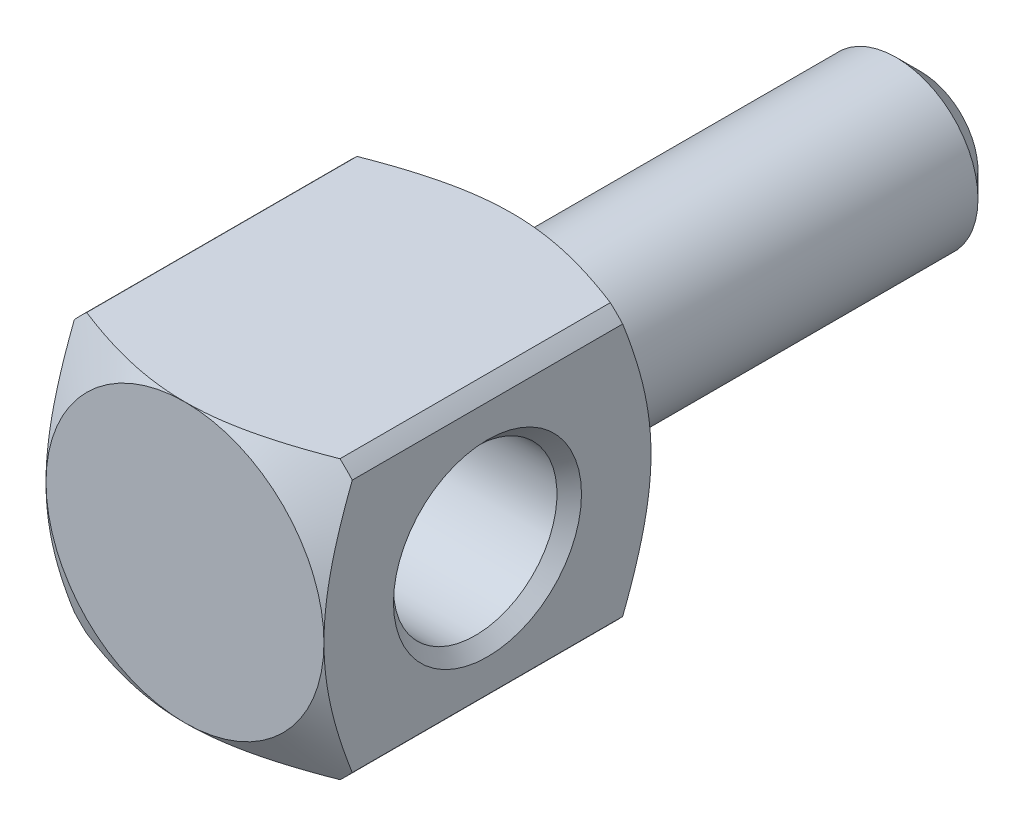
ISO-10303-21;
HEADER;
FILE_DESCRIPTION(('STEP AP214'),'2;1');
FILE_NAME('part.step','',(''),(''),'','','');
FILE_SCHEMA(('AUTOMOTIVE_DESIGN { 1 0 10303 214 1 1 1 1 }'));
ENDSEC;
DATA;
#1=APPLICATION_CONTEXT('core data for automotive mechanical design processes');
#2=APPLICATION_PROTOCOL_DEFINITION('international standard','automotive_design',2000,#1);
#3=PRODUCT_CONTEXT('',#1,'mechanical');
#4=PRODUCT('Part','Part','',(#3));
#5=PRODUCT_RELATED_PRODUCT_CATEGORY('part','',(#4));
#6=PRODUCT_DEFINITION_FORMATION('','',#4);
#7=PRODUCT_DEFINITION_CONTEXT('part definition',#1,'design');
#8=PRODUCT_DEFINITION('design','',#6,#7);
#9=PRODUCT_DEFINITION_SHAPE('','',#8);
#10=(LENGTH_UNIT() NAMED_UNIT(*) SI_UNIT(.MILLI.,.METRE.));
#11=(NAMED_UNIT(*) PLANE_ANGLE_UNIT() SI_UNIT($,.RADIAN.));
#12=(NAMED_UNIT(*) SI_UNIT($,.STERADIAN.) SOLID_ANGLE_UNIT());
#13=UNCERTAINTY_MEASURE_WITH_UNIT(LENGTH_MEASURE(1.E-05),#10,'distance_accuracy_value','');
#14=(GEOMETRIC_REPRESENTATION_CONTEXT(3) GLOBAL_UNCERTAINTY_ASSIGNED_CONTEXT((#13)) GLOBAL_UNIT_ASSIGNED_CONTEXT((#10,
#11,#12)) REPRESENTATION_CONTEXT('',''));
#15=CARTESIAN_POINT('',(0.,0.,0.));
#16=DIRECTION('',(0.,0.,1.));
#17=DIRECTION('',(1.,0.,0.));
#18=AXIS2_PLACEMENT_3D('',#15,#16,#17);
#19=CARTESIAN_POINT('',(8.5,8.5,25.));
#20=DIRECTION('',(0.,1.,0.));
#21=DIRECTION('',(-1.,0.,0.));
#22=AXIS2_PLACEMENT_3D('',#19,#20,#21);
#23=PLANE('',#22);
#24=DIRECTION('',(0.,0.,1.));
#25=VECTOR('',#24,1.);
#26=CARTESIAN_POINT('',(7.74596669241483,8.5,-25.));
#27=LINE('',#26,#25);
#28=CARTESIAN_POINT('',(7.74596669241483,8.5,43.2679491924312));
#29=VERTEX_POINT('',#28);
#30=CARTESIAN_POINT('',(7.74596669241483,8.5,26.7320508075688));
#31=VERTEX_POINT('',#30);
#32=EDGE_CURVE('E285',#29,#31,#27,.F.);
#33=ORIENTED_EDGE('',*,*,#32,.T.);
#34=CARTESIAN_POINT('',(-16.0652414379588,8.5,30.5860442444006));
#35=CARTESIAN_POINT('',(-15.6628229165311,8.5,30.3807166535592));
#36=CARTESIAN_POINT('',(-15.2597432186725,8.5,30.1766707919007));
#37=CARTESIAN_POINT('',(-14.4519168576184,8.5,29.7718320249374));
#38=CARTESIAN_POINT('',(-14.0471700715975,8.5,29.5710393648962));
#39=CARTESIAN_POINT('',(-13.234613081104,8.5,29.1728825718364));
#40=CARTESIAN_POINT('',(-12.8267975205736,8.5,28.9755293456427));
#41=CARTESIAN_POINT('',(-12.0087985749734,8.5,28.5858105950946));
#42=CARTESIAN_POINT('',(-11.5986152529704,8.5,28.393444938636));
#43=CARTESIAN_POINT('',(-10.7537268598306,8.5,28.0050416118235));
#44=CARTESIAN_POINT('',(-10.3188657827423,8.5,27.8093420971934));
#45=CARTESIAN_POINT('',(-9.44516031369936,8.5,27.426912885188));
#46=CARTESIAN_POINT('',(-9.00631563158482,8.5,27.2401838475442));
#47=CARTESIAN_POINT('',(-8.12421047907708,8.5,26.8786924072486));
#48=CARTESIAN_POINT('',(-7.68095490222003,8.5,26.7039181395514));
#49=CARTESIAN_POINT('',(-6.78862841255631,8.5,26.369996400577));
#50=CARTESIAN_POINT('',(-6.3395585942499,8.5,26.2108460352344));
#51=CARTESIAN_POINT('',(-5.43916359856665,8.5,25.9148621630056));
#52=CARTESIAN_POINT('',(-4.98790908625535,8.5,25.7778160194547));
#53=CARTESIAN_POINT('',(-4.07790183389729,8.5,25.5306120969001));
#54=CARTESIAN_POINT('',(-3.61914933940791,8.5,25.4204534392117));
#55=CARTESIAN_POINT('',(-2.93001175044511,8.5,25.281925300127));
#56=CARTESIAN_POINT('',(-2.702235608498,8.5,25.240464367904));
#57=CARTESIAN_POINT('',(-2.24521081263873,8.5,25.1667338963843));
#58=CARTESIAN_POINT('',(-2.01596233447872,8.5,25.1344632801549));
#59=CARTESIAN_POINT('',(-1.55629817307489,8.5,25.0798899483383));
#60=CARTESIAN_POINT('',(-1.32588261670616,8.5,25.0575861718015));
#61=CARTESIAN_POINT('',(-0.864262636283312,8.5,25.0235314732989));
#62=CARTESIAN_POINT('',(-0.633058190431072,8.5,25.0117808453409));
#63=CARTESIAN_POINT('',(-0.131649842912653,8.5,24.9981191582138));
#64=CARTESIAN_POINT('',(0.138610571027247,8.5,24.9981820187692));
#65=CARTESIAN_POINT('',(0.678720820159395,8.5,25.0131551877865));
#66=CARTESIAN_POINT('',(0.948570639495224,8.5,25.0280660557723));
#67=CARTESIAN_POINT('',(1.48715406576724,8.5,25.0721656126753));
#68=CARTESIAN_POINT('',(1.75588738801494,8.5,25.1013577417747));
#69=CARTESIAN_POINT('',(2.29156880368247,8.5,25.1729873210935));
#70=CARTESIAN_POINT('',(2.55851686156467,8.5,25.2154250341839));
#71=CARTESIAN_POINT('',(3.09701747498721,8.5,25.3134595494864));
#72=CARTESIAN_POINT('',(3.36851337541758,8.5,25.3693649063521));
#73=CARTESIAN_POINT('',(3.90899181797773,8.5,25.4921668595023));
#74=CARTESIAN_POINT('',(4.17797431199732,8.5,25.5590636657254));
#75=CARTESIAN_POINT('',(4.71344770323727,8.5,25.7023437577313));
#76=CARTESIAN_POINT('',(4.97993803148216,8.5,25.7787291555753));
#77=CARTESIAN_POINT('',(5.51043963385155,8.5,25.9395728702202));
#78=CARTESIAN_POINT('',(5.77445105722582,8.5,26.0240306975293));
#79=CARTESIAN_POINT('',(6.30167967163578,8.5,26.2002967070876));
#80=CARTESIAN_POINT('',(6.56488365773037,8.5,26.2921442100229));
#81=CARTESIAN_POINT('',(7.08918043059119,8.5,26.4816986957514));
#82=CARTESIAN_POINT('',(7.35027310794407,8.5,26.5794059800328));
#83=CARTESIAN_POINT('',(7.87060804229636,8.5,26.7797962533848));
#84=CARTESIAN_POINT('',(8.12984984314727,8.5,26.8824804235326));
#85=CARTESIAN_POINT('',(8.64662980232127,8.5,27.0920570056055));
#86=CARTESIAN_POINT('',(8.90416791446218,8.5,27.1989495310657));
#87=CARTESIAN_POINT('',(9.67501920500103,8.5,27.5251828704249));
#88=CARTESIAN_POINT('',(10.1860652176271,8.5,27.7498824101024));
#89=CARTESIAN_POINT('',(11.2033448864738,8.5,28.2096874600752));
#90=CARTESIAN_POINT('',(11.7095790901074,8.5,28.4447917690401));
#91=CARTESIAN_POINT('',(12.7201687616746,8.5,28.9237009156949));
#92=CARTESIAN_POINT('',(13.2245106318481,8.5,29.1675343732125));
#93=CARTESIAN_POINT('',(14.2302460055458,8.5,29.661220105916));
#94=CARTESIAN_POINT('',(14.7316394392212,8.5,29.9110725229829));
#95=CARTESIAN_POINT('',(15.7317785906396,8.5,30.4153055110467));
#96=CARTESIAN_POINT('',(16.2305256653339,8.5,30.6696833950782));
#97=CARTESIAN_POINT('',(17.2261115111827,8.5,31.1821305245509));
#98=CARTESIAN_POINT('',(17.7229502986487,8.5,31.44019973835));
#99=CARTESIAN_POINT('',(19.07807497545,8.5,32.1491999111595));
#100=CARTESIAN_POINT('',(19.9348196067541,8.5,32.6030753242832));
#101=CARTESIAN_POINT('',(21.6451290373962,8.5,33.5170951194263));
#102=CARTESIAN_POINT('',(22.4986932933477,8.5,33.9772405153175));
#103=CARTESIAN_POINT('',(24.1972485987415,8.5,34.8987499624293));
#104=CARTESIAN_POINT('',(25.042257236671,8.5,35.3600816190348));
#105=CARTESIAN_POINT('',(26.3083060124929,8.5,36.0545585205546));
#106=CARTESIAN_POINT('',(26.7300391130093,8.5,36.2864423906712));
#107=CARTESIAN_POINT('',(27.5730958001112,8.5,36.7509518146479));
#108=CARTESIAN_POINT('',(27.9944193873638,8.5,36.9835773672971));
#109=CARTESIAN_POINT('',(28.4155650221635,8.5,37.2165247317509));
#110=B_SPLINE_CURVE_WITH_KNOTS('',3,(#34,#35,#36,#37,#38,#39,#40,#41,#42,#43,#44,#45,#46,#47,
#48,#49,#50,#51,#52,#53,#54,#55,#56,#57,#58,#59,#60,#61,#62,#63,#64,#65,#66,#67,#68,#69,#70,#71,
#72,#73,#74,#75,#76,#77,#78,#79,#80,#81,#82,#83,#84,#85,#86,#87,#88,#89,#90,#91,#92,#93,#94,#95,
#96,#97,#98,#99,#100,#101,#102,#103,#104,#105,#106,#107,#108,#109),.UNSPECIFIED.,.F.,.F.,(4,2,2,
2,2,2,2,2,2,2,2,2,2,2,2,2,2,2,2,2,2,2,2,2,2,2,2,2,2,2,2,2,2,2,2,2,2,4),(0.,1.35533038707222,
2.71076248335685,4.06991001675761,5.42902151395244,6.85954625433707,8.29017604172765,
9.71936469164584,11.1482881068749,12.5625193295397,13.9767043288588,14.6711052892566,
15.3654248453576,16.0596704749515,16.7539354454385,17.5642938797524,18.3746828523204,
19.1852671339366,19.9958675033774,20.8271819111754,21.6585121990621,22.4900278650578,
23.3214931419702,24.1577196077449,24.9939891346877,25.8304580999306,26.666949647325,
28.3415558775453,30.0159692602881,31.6964930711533,33.3770565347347,35.0566534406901,
36.736235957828,39.6448246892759,42.5538894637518,45.442095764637,46.885930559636,
48.3297629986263),.UNSPECIFIED.);
#111=CARTESIAN_POINT('',(0.,8.5,25.));
#112=VERTEX_POINT('',#111);
#113=EDGE_CURVE('E225',#31,#112,#110,.F.);
#114=ORIENTED_EDGE('',*,*,#113,.T.);
#115=CARTESIAN_POINT('',(-7.74596669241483,8.5,26.7320508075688));
#116=VERTEX_POINT('',#115);
#117=EDGE_CURVE('E38',#112,#116,#110,.F.);
#118=ORIENTED_EDGE('',*,*,#117,.T.);
#119=DIRECTION('',(0.,0.,1.));
#120=VECTOR('',#119,1.);
#121=CARTESIAN_POINT('',(-7.74596669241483,8.5,-25.));
#122=LINE('',#121,#120);
#123=CARTESIAN_POINT('',(-7.74596669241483,8.5,43.2679491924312));
#124=VERTEX_POINT('',#123);
#125=EDGE_CURVE('E300',#116,#124,#122,.T.);
#126=ORIENTED_EDGE('',*,*,#125,.T.);
#127=CARTESIAN_POINT('',(-16.0652414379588,8.5,39.4139557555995));
#128=CARTESIAN_POINT('',(-15.6628229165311,8.5,39.6192833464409));
#129=CARTESIAN_POINT('',(-15.2597432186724,8.5,39.8233292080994));
#130=CARTESIAN_POINT('',(-14.4519168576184,8.5,40.2281679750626));
#131=CARTESIAN_POINT('',(-14.0471700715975,8.5,40.4289606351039));
#132=CARTESIAN_POINT('',(-13.234613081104,8.5,40.8271174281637));
#133=CARTESIAN_POINT('',(-12.8267975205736,8.5,41.0244706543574));
#134=CARTESIAN_POINT('',(-12.0087985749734,8.5,41.4141894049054));
#135=CARTESIAN_POINT('',(-11.5986152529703,8.5,41.6065550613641));
#136=CARTESIAN_POINT('',(-10.7537268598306,8.5,41.9949583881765));
#137=CARTESIAN_POINT('',(-10.3188657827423,8.5,42.1906579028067));
#138=CARTESIAN_POINT('',(-9.44516031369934,8.5,42.573087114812));
#139=CARTESIAN_POINT('',(-9.00631563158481,8.5,42.7598161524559));
#140=CARTESIAN_POINT('',(-8.12421047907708,8.5,43.1213075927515));
#141=CARTESIAN_POINT('',(-7.68095490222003,8.5,43.2960818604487));
#142=CARTESIAN_POINT('',(-6.78862841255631,8.5,43.630003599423));
#143=CARTESIAN_POINT('',(-6.33955859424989,8.5,43.7891539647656));
#144=CARTESIAN_POINT('',(-5.43916359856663,8.5,44.0851378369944));
#145=CARTESIAN_POINT('',(-4.98790908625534,8.5,44.2221839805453));
#146=CARTESIAN_POINT('',(-4.07790183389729,8.5,44.4693879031));
#147=CARTESIAN_POINT('',(-3.61914933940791,8.5,44.5795465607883));
#148=CARTESIAN_POINT('',(-2.93001175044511,8.5,44.718074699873));
#149=CARTESIAN_POINT('',(-2.702235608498,8.5,44.7595356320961));
#150=CARTESIAN_POINT('',(-2.24521081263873,8.5,44.8332661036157));
#151=CARTESIAN_POINT('',(-2.01596233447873,8.5,44.8655367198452));
#152=CARTESIAN_POINT('',(-1.55629817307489,8.5,44.9201100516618));
#153=CARTESIAN_POINT('',(-1.32588261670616,8.5,44.9424138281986));
#154=CARTESIAN_POINT('',(-0.864262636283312,8.5,44.9764685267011));
#155=CARTESIAN_POINT('',(-0.63305819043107,8.5,44.9882191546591));
#156=CARTESIAN_POINT('',(-0.131649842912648,8.5,45.0018808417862));
#157=CARTESIAN_POINT('',(0.138610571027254,8.5,45.0018179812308));
#158=CARTESIAN_POINT('',(0.678720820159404,8.5,44.9868448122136));
#159=CARTESIAN_POINT('',(0.948570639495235,8.5,44.9719339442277));
#160=CARTESIAN_POINT('',(1.48715406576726,8.5,44.9278343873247));
#161=CARTESIAN_POINT('',(1.75588738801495,8.5,44.8986422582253));
#162=CARTESIAN_POINT('',(2.29156880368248,8.5,44.8270126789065));
#163=CARTESIAN_POINT('',(2.55851686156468,8.5,44.7845749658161));
#164=CARTESIAN_POINT('',(3.09701747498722,8.5,44.6865404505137));
#165=CARTESIAN_POINT('',(3.36851337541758,8.5,44.630635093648));
#166=CARTESIAN_POINT('',(3.90899181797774,8.5,44.5078331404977));
#167=CARTESIAN_POINT('',(4.17797431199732,8.5,44.4409363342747));
#168=CARTESIAN_POINT('',(4.71344770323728,8.5,44.2976562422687));
#169=CARTESIAN_POINT('',(4.97993803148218,8.5,44.2212708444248));
#170=CARTESIAN_POINT('',(5.51043963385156,8.5,44.0604271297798));
#171=CARTESIAN_POINT('',(5.77445105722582,8.5,43.9759693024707));
#172=CARTESIAN_POINT('',(6.30167967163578,8.5,43.7997032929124));
#173=CARTESIAN_POINT('',(6.56488365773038,8.5,43.7078557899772));
#174=CARTESIAN_POINT('',(7.08918043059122,8.5,43.5183013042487));
#175=CARTESIAN_POINT('',(7.3502731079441,8.5,43.4205940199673));
#176=CARTESIAN_POINT('',(7.87060804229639,8.5,43.2202037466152));
#177=CARTESIAN_POINT('',(8.1298498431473,8.5,43.1175195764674));
#178=CARTESIAN_POINT('',(8.64662980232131,8.5,42.9079429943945));
#179=CARTESIAN_POINT('',(8.90416791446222,8.5,42.8010504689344));
#180=CARTESIAN_POINT('',(9.67501920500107,8.5,42.4748171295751));
#181=CARTESIAN_POINT('',(10.1860652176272,8.5,42.2501175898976));
#182=CARTESIAN_POINT('',(11.2033448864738,8.5,41.7903125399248));
#183=CARTESIAN_POINT('',(11.7095790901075,8.5,41.55520823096));
#184=CARTESIAN_POINT('',(12.7201687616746,8.5,41.0762990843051));
#185=CARTESIAN_POINT('',(13.2245106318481,8.5,40.8324656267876));
#186=CARTESIAN_POINT('',(14.2302460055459,8.5,40.338779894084));
#187=CARTESIAN_POINT('',(14.7316394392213,8.5,40.0889274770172));
#188=CARTESIAN_POINT('',(15.7317785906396,8.5,39.5846944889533));
#189=CARTESIAN_POINT('',(16.2305256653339,8.5,39.3303166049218));
#190=CARTESIAN_POINT('',(17.2261115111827,8.5,38.8178694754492));
#191=CARTESIAN_POINT('',(17.7229502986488,8.5,38.55980026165));
#192=CARTESIAN_POINT('',(19.0780749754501,8.5,37.8508000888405));
#193=CARTESIAN_POINT('',(19.9348196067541,8.5,37.3969246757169));
#194=CARTESIAN_POINT('',(21.6451290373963,8.5,36.4829048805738));
#195=CARTESIAN_POINT('',(22.4986932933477,8.5,36.0227594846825));
#196=CARTESIAN_POINT('',(24.1972485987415,8.5,35.1012500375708));
#197=CARTESIAN_POINT('',(25.042257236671,8.5,34.6399183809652));
#198=CARTESIAN_POINT('',(26.3083060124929,8.5,33.9454414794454));
#199=CARTESIAN_POINT('',(26.7300391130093,8.5,33.7135576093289));
#200=CARTESIAN_POINT('',(27.5730958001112,8.5,33.2490481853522));
#201=CARTESIAN_POINT('',(27.9944193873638,8.5,33.0164226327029));
#202=CARTESIAN_POINT('',(28.4155650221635,8.5,32.7834752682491));
#203=B_SPLINE_CURVE_WITH_KNOTS('',3,(#127,#128,#129,#130,#131,#132,#133,#134,#135,#136,#137,
#138,#139,#140,#141,#142,#143,#144,#145,#146,#147,#148,#149,#150,#151,#152,#153,#154,#155,#156,
#157,#158,#159,#160,#161,#162,#163,#164,#165,#166,#167,#168,#169,#170,#171,#172,#173,#174,#175,
#176,#177,#178,#179,#180,#181,#182,#183,#184,#185,#186,#187,#188,#189,#190,#191,#192,#193,#194,
#195,#196,#197,#198,#199,#200,#201,#202),.UNSPECIFIED.,.F.,.F.,(4,2,2,2,2,2,2,2,2,2,2,2,2,2,2,2,
2,2,2,2,2,2,2,2,2,2,2,2,2,2,2,2,2,2,2,2,2,4),(0.,1.35533038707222,2.71076248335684,
4.06991001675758,5.4290215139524,6.85954625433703,8.29017604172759,9.71936469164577,
11.1482881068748,12.5625193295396,13.9767043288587,14.6711052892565,15.3654248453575,
16.0596704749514,16.7539354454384,17.5642938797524,18.3746828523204,19.1852671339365,
19.9958675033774,20.8271819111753,21.658512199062,22.4900278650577,23.3214931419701,
24.1577196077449,24.9939891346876,25.8304580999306,26.666949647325,28.3415558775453,
30.015969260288,31.6964930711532,33.3770565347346,35.0566534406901,36.736235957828,
39.6448246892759,42.5538894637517,45.4420957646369,46.885930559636,48.3297629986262),.UNSPECIFIED.);
#204=CARTESIAN_POINT('',(0.,8.5,45.));
#205=VERTEX_POINT('',#204);
#206=EDGE_CURVE('E216',#124,#205,#203,.T.);
#207=ORIENTED_EDGE('',*,*,#206,.T.);
#208=EDGE_CURVE('E209',#205,#29,#203,.T.);
#209=ORIENTED_EDGE('',*,*,#208,.T.);
#210=EDGE_LOOP('',(#33,#114,#118,#126,#207,#209));
#211=FACE_BOUND('',#210,.T.);
#212=ADVANCED_FACE('F14',(#211),#23,.T.);
#213=CARTESIAN_POINT('',(8.5,8.5,25.));
#214=DIRECTION('',(-1.,0.,0.));
#215=DIRECTION('',(0.,0.,-1.));
#216=AXIS2_PLACEMENT_3D('',#213,#214,#215);
#217=PLANE('',#216);
#218=CARTESIAN_POINT('',(8.5,0.,35.));
#219=DIRECTION('',(-1.,0.,0.));
#220=DIRECTION('',(0.,0.,-1.));
#221=AXIS2_PLACEMENT_3D('',#218,#219,#220);
#222=CIRCLE('',#221,5.75);
#223=CARTESIAN_POINT('',(8.5,0.,29.25));
#224=VERTEX_POINT('',#223);
#225=EDGE_CURVE('E135',#224,#224,#222,.T.);
#226=ORIENTED_EDGE('',*,*,#225,.T.);
#227=EDGE_LOOP('',(#226));
#228=FACE_BOUND('',#227,.T.);
#229=CARTESIAN_POINT('',(8.5,16.0652414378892,30.5860442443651));
#230=CARTESIAN_POINT('',(8.5,15.662822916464,30.3807166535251));
#231=CARTESIAN_POINT('',(8.5,15.2597432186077,30.176670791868));
#232=CARTESIAN_POINT('',(8.5,14.4519168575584,29.7718320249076));
#233=CARTESIAN_POINT('',(8.5,14.0471700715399,29.5710393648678));
#234=CARTESIAN_POINT('',(8.5,13.2346130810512,29.1728825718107));
#235=CARTESIAN_POINT('',(8.5,12.8267975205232,28.9755293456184));
#236=CARTESIAN_POINT('',(8.5,12.0087985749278,28.5858105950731));
#237=CARTESIAN_POINT('',(8.5,11.5986152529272,28.3934449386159));
#238=CARTESIAN_POINT('',(8.5,10.7537268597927,28.0050416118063));
#239=CARTESIAN_POINT('',(8.5,10.3188657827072,27.8093420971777));
#240=CARTESIAN_POINT('',(8.5,9.44516031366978,27.4269128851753));
#241=CARTESIAN_POINT('',(8.5,9.00631563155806,27.240183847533));
#242=CARTESIAN_POINT('',(8.5,8.12421047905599,26.8786924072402));
#243=CARTESIAN_POINT('',(8.5,7.6809549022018,26.7039181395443));
#244=CARTESIAN_POINT('',(8.5,6.78862841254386,26.3699964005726));
#245=CARTESIAN_POINT('',(8.5,6.33955859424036,26.2108460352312));
#246=CARTESIAN_POINT('',(8.5,5.43916359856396,25.9148621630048));
#247=CARTESIAN_POINT('',(8.5,4.98790908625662,25.7778160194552));
#248=CARTESIAN_POINT('',(8.5,4.0779018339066,25.5306120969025));
#249=CARTESIAN_POINT('',(8.5,3.61914933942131,25.4204534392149));
#250=CARTESIAN_POINT('',(8.5,2.93001175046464,25.2819253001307));
#251=CARTESIAN_POINT('',(8.5,2.70223560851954,25.2404643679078));
#252=CARTESIAN_POINT('',(8.5,2.24521081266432,25.1667338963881));
#253=CARTESIAN_POINT('',(8.5,2.01596233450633,25.1344632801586));
#254=CARTESIAN_POINT('',(8.5,1.55629817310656,25.0798899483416));
#255=CARTESIAN_POINT('',(8.5,1.32588261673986,25.0575861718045));
#256=CARTESIAN_POINT('',(8.5,0.864262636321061,25.0235314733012));
#257=CARTESIAN_POINT('',(8.5,0.633058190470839,25.0117808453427));
#258=CARTESIAN_POINT('',(8.5,0.131649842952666,24.9981191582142));
#259=CARTESIAN_POINT('',(8.5,-0.138610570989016,24.9981820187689));
#260=CARTESIAN_POINT('',(8.5,-0.678720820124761,25.0131551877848));
#261=CARTESIAN_POINT('',(8.5,-0.948570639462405,25.0280660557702));
#262=CARTESIAN_POINT('',(8.5,-1.48715406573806,25.0721656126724));
#263=CARTESIAN_POINT('',(8.5,-1.75588738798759,25.1013577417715));
#264=CARTESIAN_POINT('',(8.5,-2.29156880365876,25.1729873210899));
#265=CARTESIAN_POINT('',(8.5,-2.55851686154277,25.2154250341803));
#266=CARTESIAN_POINT('',(8.5,-3.097017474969,25.3134595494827));
#267=CARTESIAN_POINT('',(8.5,-3.36851337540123,25.3693649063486));
#268=CARTESIAN_POINT('',(8.5,-3.90899181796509,25.4921668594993));
#269=CARTESIAN_POINT('',(8.5,-4.17797431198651,25.5590636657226));
#270=CARTESIAN_POINT('',(8.5,-4.71344770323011,25.7023437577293));
#271=CARTESIAN_POINT('',(8.5,-4.97993803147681,25.7787291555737));
#272=CARTESIAN_POINT('',(8.5,-5.51043963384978,25.9395728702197));
#273=CARTESIAN_POINT('',(8.5,-5.77445105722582,26.0240306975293));
#274=CARTESIAN_POINT('',(8.5,-6.30167967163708,26.2002967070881));
#275=CARTESIAN_POINT('',(8.5,-6.56488365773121,26.2921442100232));
#276=CARTESIAN_POINT('',(8.5,-7.08918043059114,26.4816986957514));
#277=CARTESIAN_POINT('',(8.5,-7.35027310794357,26.5794059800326));
#278=CARTESIAN_POINT('',(8.5,-7.87060804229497,26.7797962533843));
#279=CARTESIAN_POINT('',(8.5,-8.12984984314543,26.8824804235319));
#280=CARTESIAN_POINT('',(8.5,-8.64662980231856,27.0920570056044));
#281=CARTESIAN_POINT('',(8.5,-8.90416791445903,27.1989495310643));
#282=CARTESIAN_POINT('',(8.5,-9.67501920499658,27.525182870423));
#283=CARTESIAN_POINT('',(8.5,-10.1860652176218,27.7498824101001));
#284=CARTESIAN_POINT('',(8.5,-11.2033448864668,28.209687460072));
#285=CARTESIAN_POINT('',(8.5,-11.7095790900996,28.4447917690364));
#286=CARTESIAN_POINT('',(8.5,-12.720168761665,28.9237009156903));
#287=CARTESIAN_POINT('',(8.5,-13.2245106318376,29.1675343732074));
#288=CARTESIAN_POINT('',(8.5,-14.2302460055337,29.66122010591));
#289=CARTESIAN_POINT('',(8.5,-14.7316394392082,29.9110725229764));
#290=CARTESIAN_POINT('',(8.5,-15.7317785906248,30.4153055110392));
#291=CARTESIAN_POINT('',(8.5,-16.2305256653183,30.6696833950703));
#292=CARTESIAN_POINT('',(8.5,-17.2261115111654,31.1821305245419));
#293=CARTESIAN_POINT('',(8.5,-17.7229502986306,31.4401997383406));
#294=CARTESIAN_POINT('',(8.5,-19.0780749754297,32.1491999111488));
#295=CARTESIAN_POINT('',(8.5,-19.9348196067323,32.6030753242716));
#296=CARTESIAN_POINT('',(8.5,-21.6451290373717,33.5170951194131));
#297=CARTESIAN_POINT('',(8.5,-22.4986932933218,33.9772405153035));
#298=CARTESIAN_POINT('',(8.5,-24.1972485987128,34.8987499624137));
#299=CARTESIAN_POINT('',(8.5,-25.042257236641,35.3600816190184));
#300=CARTESIAN_POINT('',(8.5,-26.3083060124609,36.054558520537));
#301=CARTESIAN_POINT('',(8.5,-26.7300391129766,36.2864423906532));
#302=CARTESIAN_POINT('',(8.5,-27.5730958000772,36.7509518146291));
#303=CARTESIAN_POINT('',(8.5,-27.9944193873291,36.983577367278));
#304=CARTESIAN_POINT('',(8.5,-28.4155650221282,37.2165247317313));
#305=B_SPLINE_CURVE_WITH_KNOTS('',3,(#229,#230,#231,#232,#233,#234,#235,#236,#237,#238,#239,
#240,#241,#242,#243,#244,#245,#246,#247,#248,#249,#250,#251,#252,#253,#254,#255,#256,#257,#258,
#259,#260,#261,#262,#263,#264,#265,#266,#267,#268,#269,#270,#271,#272,#273,#274,#275,#276,#277,
#278,#279,#280,#281,#282,#283,#284,#285,#286,#287,#288,#289,#290,#291,#292,#293,#294,#295,#296,
#297,#298,#299,#300,#301,#302,#303,#304),.UNSPECIFIED.,.F.,.F.,(4,2,2,2,2,2,2,2,2,2,2,2,2,2,2,2,
2,2,2,2,2,2,2,2,2,2,2,2,2,2,2,2,2,2,2,2,2,4),(0.,1.35533038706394,2.71076248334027,
4.06991001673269,5.42902151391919,6.85954625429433,8.29017604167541,9.71936469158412,
11.1482881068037,12.5625193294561,13.9767043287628,14.6711052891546,15.3654248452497,
16.0596704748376,16.7539354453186,17.5642938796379,18.3746828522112,19.1852671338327,
19.9958675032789,20.8271819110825,21.6585121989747,22.4900278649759,23.3214931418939,
24.1577196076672,24.9939891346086,25.8304580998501,26.666949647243,28.3415558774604,
30.0159692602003,31.6964930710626,33.377056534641,35.0566534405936,36.7362359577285,
39.6448246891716,42.5538894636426,45.4420957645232,46.8859305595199,48.3297629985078),.UNSPECIFIED.);
#306=CARTESIAN_POINT('',(8.5,7.74596669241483,26.7320508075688));
#307=VERTEX_POINT('',#306);
#308=CARTESIAN_POINT('',(8.5,0.,25.));
#309=VERTEX_POINT('',#308);
#310=EDGE_CURVE('E30',#307,#309,#305,.T.);
#311=ORIENTED_EDGE('',*,*,#310,.F.);
#312=DIRECTION('',(0.,0.,1.));
#313=VECTOR('',#312,1.);
#314=CARTESIAN_POINT('',(8.5,7.74596669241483,-25.));
#315=LINE('',#314,#313);
#316=CARTESIAN_POINT('',(8.5,7.74596669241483,43.2679491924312));
#317=VERTEX_POINT('',#316);
#318=EDGE_CURVE('E288',#317,#307,#315,.F.);
#319=ORIENTED_EDGE('',*,*,#318,.F.);
#320=CARTESIAN_POINT('',(8.5,16.0652414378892,39.4139557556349));
#321=CARTESIAN_POINT('',(8.5,15.662822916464,39.6192833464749));
#322=CARTESIAN_POINT('',(8.5,15.2597432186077,39.8233292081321));
#323=CARTESIAN_POINT('',(8.5,14.4519168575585,40.2281679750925));
#324=CARTESIAN_POINT('',(8.5,14.0471700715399,40.4289606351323));
#325=CARTESIAN_POINT('',(8.5,13.2346130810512,40.8271174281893));
#326=CARTESIAN_POINT('',(8.5,12.8267975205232,41.0244706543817));
#327=CARTESIAN_POINT('',(8.5,12.0087985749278,41.4141894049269));
#328=CARTESIAN_POINT('',(8.5,11.5986152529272,41.6065550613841));
#329=CARTESIAN_POINT('',(8.5,10.7537268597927,41.9949583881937));
#330=CARTESIAN_POINT('',(8.5,10.3188657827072,42.1906579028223));
#331=CARTESIAN_POINT('',(8.5,9.4451603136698,42.5730871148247));
#332=CARTESIAN_POINT('',(8.5,9.00631563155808,42.7598161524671));
#333=CARTESIAN_POINT('',(8.5,8.12421047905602,43.1213075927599));
#334=CARTESIAN_POINT('',(8.5,7.68095490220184,43.2960818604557));
#335=CARTESIAN_POINT('',(8.5,6.78862841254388,43.6300035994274));
#336=CARTESIAN_POINT('',(8.5,6.33955859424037,43.7891539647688));
#337=CARTESIAN_POINT('',(8.5,5.43916359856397,44.0851378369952));
#338=CARTESIAN_POINT('',(8.5,4.98790908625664,44.2221839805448));
#339=CARTESIAN_POINT('',(8.5,4.07790183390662,44.4693879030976));
#340=CARTESIAN_POINT('',(8.5,3.61914933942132,44.5795465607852));
#341=CARTESIAN_POINT('',(8.5,2.93001175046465,44.7180746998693));
#342=CARTESIAN_POINT('',(8.5,2.70223560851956,44.7595356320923));
#343=CARTESIAN_POINT('',(8.5,2.24521081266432,44.8332661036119));
#344=CARTESIAN_POINT('',(8.5,2.01596233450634,44.8655367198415));
#345=CARTESIAN_POINT('',(8.5,1.55629817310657,44.9201100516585));
#346=CARTESIAN_POINT('',(8.5,1.32588261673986,44.9424138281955));
#347=CARTESIAN_POINT('',(8.5,0.864262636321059,44.9764685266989));
#348=CARTESIAN_POINT('',(8.5,0.633058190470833,44.9882191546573));
#349=CARTESIAN_POINT('',(8.5,0.131649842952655,45.0018808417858));
#350=CARTESIAN_POINT('',(8.5,-0.138610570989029,45.0018179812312));
#351=CARTESIAN_POINT('',(8.5,-0.678720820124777,44.9868448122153));
#352=CARTESIAN_POINT('',(8.5,-0.948570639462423,44.9719339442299));
#353=CARTESIAN_POINT('',(8.5,-1.48715406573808,44.9278343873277));
#354=CARTESIAN_POINT('',(8.5,-1.7558873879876,44.8986422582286));
#355=CARTESIAN_POINT('',(8.5,-2.29156880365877,44.8270126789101));
#356=CARTESIAN_POINT('',(8.5,-2.55851686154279,44.7845749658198));
#357=CARTESIAN_POINT('',(8.5,-3.09701747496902,44.6865404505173));
#358=CARTESIAN_POINT('',(8.5,-3.36851337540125,44.6306350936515));
#359=CARTESIAN_POINT('',(8.5,-3.90899181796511,44.5078331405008));
#360=CARTESIAN_POINT('',(8.5,-4.17797431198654,44.4409363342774));
#361=CARTESIAN_POINT('',(8.5,-4.71344770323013,44.2976562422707));
#362=CARTESIAN_POINT('',(8.5,-4.97993803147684,44.2212708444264));
#363=CARTESIAN_POINT('',(8.5,-5.5104396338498,44.0604271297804));
#364=CARTESIAN_POINT('',(8.5,-5.77445105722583,43.9759693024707));
#365=CARTESIAN_POINT('',(8.5,-6.30167967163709,43.7997032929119));
#366=CARTESIAN_POINT('',(8.5,-6.56488365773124,43.7078557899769));
#367=CARTESIAN_POINT('',(8.5,-7.08918043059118,43.5183013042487));
#368=CARTESIAN_POINT('',(8.5,-7.35027310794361,43.4205940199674));
#369=CARTESIAN_POINT('',(8.5,-7.87060804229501,43.2202037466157));
#370=CARTESIAN_POINT('',(8.5,-8.12984984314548,43.1175195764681));
#371=CARTESIAN_POINT('',(8.5,-8.6466298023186,42.9079429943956));
#372=CARTESIAN_POINT('',(8.5,-8.90416791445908,42.8010504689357));
#373=CARTESIAN_POINT('',(8.5,-9.67501920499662,42.4748171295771));
#374=CARTESIAN_POINT('',(8.5,-10.1860652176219,42.2501175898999));
#375=CARTESIAN_POINT('',(8.5,-11.2033448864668,41.790312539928));
#376=CARTESIAN_POINT('',(8.5,-11.7095790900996,41.5552082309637));
#377=CARTESIAN_POINT('',(8.5,-12.720168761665,41.0762990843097));
#378=CARTESIAN_POINT('',(8.5,-13.2245106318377,40.8324656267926));
#379=CARTESIAN_POINT('',(8.5,-14.2302460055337,40.3387798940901));
#380=CARTESIAN_POINT('',(8.5,-14.7316394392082,40.0889274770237));
#381=CARTESIAN_POINT('',(8.5,-15.7317785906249,39.5846944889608));
#382=CARTESIAN_POINT('',(8.5,-16.2305256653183,39.3303166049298));
#383=CARTESIAN_POINT('',(8.5,-17.2261115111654,38.8178694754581));
#384=CARTESIAN_POINT('',(8.5,-17.7229502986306,38.5598002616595));
#385=CARTESIAN_POINT('',(8.5,-19.0780749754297,37.8508000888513));
#386=CARTESIAN_POINT('',(8.5,-19.9348196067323,37.3969246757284));
#387=CARTESIAN_POINT('',(8.5,-21.6451290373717,36.482904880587));
#388=CARTESIAN_POINT('',(8.5,-22.4986932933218,36.0227594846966));
#389=CARTESIAN_POINT('',(8.5,-24.1972485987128,35.1012500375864));
#390=CARTESIAN_POINT('',(8.5,-25.042257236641,34.6399183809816));
#391=CARTESIAN_POINT('',(8.5,-26.3083060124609,33.945441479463));
#392=CARTESIAN_POINT('',(8.5,-26.7300391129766,33.7135576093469));
#393=CARTESIAN_POINT('',(8.5,-27.5730958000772,33.2490481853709));
#394=CARTESIAN_POINT('',(8.5,-27.9944193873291,33.0164226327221));
#395=CARTESIAN_POINT('',(8.5,-28.4155650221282,32.7834752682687));
#396=B_SPLINE_CURVE_WITH_KNOTS('',3,(#320,#321,#322,#323,#324,#325,#326,#327,#328,#329,#330,
#331,#332,#333,#334,#335,#336,#337,#338,#339,#340,#341,#342,#343,#344,#345,#346,#347,#348,#349,
#350,#351,#352,#353,#354,#355,#356,#357,#358,#359,#360,#361,#362,#363,#364,#365,#366,#367,#368,
#369,#370,#371,#372,#373,#374,#375,#376,#377,#378,#379,#380,#381,#382,#383,#384,#385,#386,#387,
#388,#389,#390,#391,#392,#393,#394,#395),.UNSPECIFIED.,.F.,.F.,(4,2,2,2,2,2,2,2,2,2,2,2,2,2,2,2,
2,2,2,2,2,2,2,2,2,2,2,2,2,2,2,2,2,2,2,2,2,4),(0.,1.35533038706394,2.71076248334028,
4.06991001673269,5.42902151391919,6.85954625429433,8.29017604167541,9.71936469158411,
11.1482881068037,12.5625193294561,13.9767043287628,14.6711052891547,15.3654248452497,
16.0596704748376,16.7539354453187,17.5642938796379,18.3746828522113,19.1852671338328,
19.995867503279,20.8271819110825,21.6585121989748,22.490027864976,23.321493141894,
24.1577196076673,24.9939891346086,25.8304580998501,26.6669496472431,28.3415558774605,
30.0159692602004,31.6964930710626,33.3770565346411,35.0566534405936,36.7362359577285,
39.6448246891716,42.5538894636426,45.4420957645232,46.8859305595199,48.3297629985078),.UNSPECIFIED.);
#397=CARTESIAN_POINT('',(8.5,0.,45.));
#398=VERTEX_POINT('',#397);
#399=EDGE_CURVE('E202',#398,#317,#396,.F.);
#400=ORIENTED_EDGE('',*,*,#399,.F.);
#401=CARTESIAN_POINT('',(8.5,-7.74596669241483,43.2679491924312));
#402=VERTEX_POINT('',#401);
#403=EDGE_CURVE('E217',#402,#398,#396,.F.);
#404=ORIENTED_EDGE('',*,*,#403,.F.);
#405=DIRECTION('',(0.,0.,1.));
#406=VECTOR('',#405,1.);
#407=CARTESIAN_POINT('',(8.5,-7.74596669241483,-25.));
#408=LINE('',#407,#406);
#409=CARTESIAN_POINT('',(8.5,-7.74596669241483,26.7320508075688));
#410=VERTEX_POINT('',#409);
#411=EDGE_CURVE('E293',#410,#402,#408,.T.);
#412=ORIENTED_EDGE('',*,*,#411,.F.);
#413=EDGE_CURVE('E233',#309,#410,#305,.T.);
#414=ORIENTED_EDGE('',*,*,#413,.F.);
#415=EDGE_LOOP('',(#311,#319,#400,#404,#412,#414));
#416=FACE_BOUND('',#415,.T.);
#417=ADVANCED_FACE('F165',(#228,#416),#217,.F.);
#418=CARTESIAN_POINT('',(8.5,-8.5,25.));
#419=DIRECTION('',(0.,1.,0.));
#420=DIRECTION('',(0.,0.,1.));
#421=AXIS2_PLACEMENT_3D('',#418,#419,#420);
#422=PLANE('',#421);
#423=CARTESIAN_POINT('',(-16.0652414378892,-8.5,30.5860442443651));
#424=CARTESIAN_POINT('',(-15.662822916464,-8.5,30.3807166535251));
#425=CARTESIAN_POINT('',(-15.2597432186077,-8.5,30.176670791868));
#426=CARTESIAN_POINT('',(-14.4519168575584,-8.5,29.7718320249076));
#427=CARTESIAN_POINT('',(-14.0471700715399,-8.5,29.5710393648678));
#428=CARTESIAN_POINT('',(-13.2346130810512,-8.5,29.1728825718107));
#429=CARTESIAN_POINT('',(-12.8267975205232,-8.5,28.9755293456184));
#430=CARTESIAN_POINT('',(-12.0087985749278,-8.5,28.5858105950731));
#431=CARTESIAN_POINT('',(-11.5986152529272,-8.5,28.3934449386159));
#432=CARTESIAN_POINT('',(-10.7537268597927,-8.5,28.0050416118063));
#433=CARTESIAN_POINT('',(-10.3188657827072,-8.5,27.8093420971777));
#434=CARTESIAN_POINT('',(-9.44516031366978,-8.5,27.4269128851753));
#435=CARTESIAN_POINT('',(-9.00631563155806,-8.5,27.240183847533));
#436=CARTESIAN_POINT('',(-8.12421047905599,-8.5,26.8786924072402));
#437=CARTESIAN_POINT('',(-7.6809549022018,-8.5,26.7039181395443));
#438=CARTESIAN_POINT('',(-6.78862841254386,-8.5,26.3699964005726));
#439=CARTESIAN_POINT('',(-6.33955859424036,-8.5,26.2108460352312));
#440=CARTESIAN_POINT('',(-5.43916359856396,-8.5,25.9148621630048));
#441=CARTESIAN_POINT('',(-4.98790908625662,-8.5,25.7778160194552));
#442=CARTESIAN_POINT('',(-4.0779018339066,-8.5,25.5306120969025));
#443=CARTESIAN_POINT('',(-3.61914933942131,-8.5,25.4204534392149));
#444=CARTESIAN_POINT('',(-2.93001175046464,-8.5,25.2819253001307));
#445=CARTESIAN_POINT('',(-2.70223560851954,-8.5,25.2404643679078));
#446=CARTESIAN_POINT('',(-2.24521081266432,-8.5,25.1667338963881));
#447=CARTESIAN_POINT('',(-2.01596233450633,-8.5,25.1344632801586));
#448=CARTESIAN_POINT('',(-1.55629817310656,-8.5,25.0798899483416));
#449=CARTESIAN_POINT('',(-1.32588261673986,-8.5,25.0575861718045));
#450=CARTESIAN_POINT('',(-0.864262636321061,-8.5,25.0235314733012));
#451=CARTESIAN_POINT('',(-0.633058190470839,-8.5,25.0117808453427));
#452=CARTESIAN_POINT('',(-0.131649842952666,-8.5,24.9981191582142));
#453=CARTESIAN_POINT('',(0.138610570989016,-8.5,24.9981820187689));
#454=CARTESIAN_POINT('',(0.678720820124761,-8.5,25.0131551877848));
#455=CARTESIAN_POINT('',(0.948570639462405,-8.5,25.0280660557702));
#456=CARTESIAN_POINT('',(1.48715406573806,-8.5,25.0721656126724));
#457=CARTESIAN_POINT('',(1.75588738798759,-8.5,25.1013577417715));
#458=CARTESIAN_POINT('',(2.29156880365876,-8.5,25.1729873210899));
#459=CARTESIAN_POINT('',(2.55851686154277,-8.5,25.2154250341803));
#460=CARTESIAN_POINT('',(3.097017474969,-8.5,25.3134595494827));
#461=CARTESIAN_POINT('',(3.36851337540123,-8.5,25.3693649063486));
#462=CARTESIAN_POINT('',(3.90899181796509,-8.5,25.4921668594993));
#463=CARTESIAN_POINT('',(4.17797431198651,-8.5,25.5590636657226));
#464=CARTESIAN_POINT('',(4.71344770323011,-8.5,25.7023437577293));
#465=CARTESIAN_POINT('',(4.97993803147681,-8.5,25.7787291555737));
#466=CARTESIAN_POINT('',(5.51043963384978,-8.5,25.9395728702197));
#467=CARTESIAN_POINT('',(5.77445105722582,-8.5,26.0240306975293));
#468=CARTESIAN_POINT('',(6.30167967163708,-8.5,26.2002967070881));
#469=CARTESIAN_POINT('',(6.56488365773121,-8.5,26.2921442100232));
#470=CARTESIAN_POINT('',(7.08918043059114,-8.5,26.4816986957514));
#471=CARTESIAN_POINT('',(7.35027310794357,-8.5,26.5794059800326));
#472=CARTESIAN_POINT('',(7.87060804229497,-8.5,26.7797962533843));
#473=CARTESIAN_POINT('',(8.12984984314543,-8.5,26.8824804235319));
#474=CARTESIAN_POINT('',(8.64662980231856,-8.5,27.0920570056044));
#475=CARTESIAN_POINT('',(8.90416791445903,-8.5,27.1989495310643));
#476=CARTESIAN_POINT('',(9.67501920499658,-8.5,27.525182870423));
#477=CARTESIAN_POINT('',(10.1860652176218,-8.5,27.7498824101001));
#478=CARTESIAN_POINT('',(11.2033448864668,-8.5,28.209687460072));
#479=CARTESIAN_POINT('',(11.7095790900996,-8.5,28.4447917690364));
#480=CARTESIAN_POINT('',(12.720168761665,-8.5,28.9237009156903));
#481=CARTESIAN_POINT('',(13.2245106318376,-8.5,29.1675343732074));
#482=CARTESIAN_POINT('',(14.2302460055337,-8.5,29.66122010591));
#483=CARTESIAN_POINT('',(14.7316394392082,-8.5,29.9110725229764));
#484=CARTESIAN_POINT('',(15.7317785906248,-8.5,30.4153055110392));
#485=CARTESIAN_POINT('',(16.2305256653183,-8.5,30.6696833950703));
#486=CARTESIAN_POINT('',(17.2261115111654,-8.5,31.1821305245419));
#487=CARTESIAN_POINT('',(17.7229502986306,-8.5,31.4401997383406));
#488=CARTESIAN_POINT('',(19.0780749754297,-8.5,32.1491999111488));
#489=CARTESIAN_POINT('',(19.9348196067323,-8.5,32.6030753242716));
#490=CARTESIAN_POINT('',(21.6451290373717,-8.5,33.5170951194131));
#491=CARTESIAN_POINT('',(22.4986932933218,-8.5,33.9772405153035));
#492=CARTESIAN_POINT('',(24.1972485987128,-8.5,34.8987499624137));
#493=CARTESIAN_POINT('',(25.042257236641,-8.5,35.3600816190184));
#494=CARTESIAN_POINT('',(26.3083060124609,-8.5,36.054558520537));
#495=CARTESIAN_POINT('',(26.7300391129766,-8.5,36.2864423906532));
#496=CARTESIAN_POINT('',(27.5730958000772,-8.5,36.7509518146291));
#497=CARTESIAN_POINT('',(27.9944193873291,-8.5,36.983577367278));
#498=CARTESIAN_POINT('',(28.4155650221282,-8.5,37.2165247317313));
#499=B_SPLINE_CURVE_WITH_KNOTS('',3,(#423,#424,#425,#426,#427,#428,#429,#430,#431,#432,#433,
#434,#435,#436,#437,#438,#439,#440,#441,#442,#443,#444,#445,#446,#447,#448,#449,#450,#451,#452,
#453,#454,#455,#456,#457,#458,#459,#460,#461,#462,#463,#464,#465,#466,#467,#468,#469,#470,#471,
#472,#473,#474,#475,#476,#477,#478,#479,#480,#481,#482,#483,#484,#485,#486,#487,#488,#489,#490,
#491,#492,#493,#494,#495,#496,#497,#498),.UNSPECIFIED.,.F.,.F.,(4,2,2,2,2,2,2,2,2,2,2,2,2,2,2,2,
2,2,2,2,2,2,2,2,2,2,2,2,2,2,2,2,2,2,2,2,2,4),(0.,1.35533038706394,2.71076248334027,
4.06991001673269,5.42902151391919,6.85954625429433,8.29017604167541,9.71936469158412,
11.1482881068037,12.5625193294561,13.9767043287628,14.6711052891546,15.3654248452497,
16.0596704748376,16.7539354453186,17.5642938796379,18.3746828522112,19.1852671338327,
19.9958675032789,20.8271819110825,21.6585121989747,22.4900278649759,23.3214931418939,
24.1577196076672,24.9939891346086,25.8304580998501,26.666949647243,28.3415558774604,
30.0159692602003,31.6964930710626,33.377056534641,35.0566534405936,36.7362359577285,
39.6448246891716,42.5538894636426,45.4420957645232,46.8859305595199,48.3297629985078),.UNSPECIFIED.);
#500=CARTESIAN_POINT('',(7.74596669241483,-8.5,26.7320508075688));
#501=VERTEX_POINT('',#500);
#502=CARTESIAN_POINT('',(0.,-8.5,25.));
#503=VERTEX_POINT('',#502);
#504=EDGE_CURVE('E103',#501,#503,#499,.F.);
#505=ORIENTED_EDGE('',*,*,#504,.F.);
#506=DIRECTION('',(0.,0.,1.));
#507=VECTOR('',#506,1.);
#508=CARTESIAN_POINT('',(7.74596669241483,-8.5,-25.));
#509=LINE('',#508,#507);
#510=CARTESIAN_POINT('',(7.74596669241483,-8.5,43.2679491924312));
#511=VERTEX_POINT('',#510);
#512=EDGE_CURVE('E295',#511,#501,#509,.F.);
#513=ORIENTED_EDGE('',*,*,#512,.F.);
#514=CARTESIAN_POINT('',(-16.0652414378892,-8.5,39.4139557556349));
#515=CARTESIAN_POINT('',(-15.662822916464,-8.5,39.6192833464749));
#516=CARTESIAN_POINT('',(-15.2597432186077,-8.5,39.8233292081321));
#517=CARTESIAN_POINT('',(-14.4519168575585,-8.5,40.2281679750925));
#518=CARTESIAN_POINT('',(-14.0471700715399,-8.5,40.4289606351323));
#519=CARTESIAN_POINT('',(-13.2346130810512,-8.5,40.8271174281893));
#520=CARTESIAN_POINT('',(-12.8267975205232,-8.5,41.0244706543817));
#521=CARTESIAN_POINT('',(-12.0087985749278,-8.5,41.4141894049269));
#522=CARTESIAN_POINT('',(-11.5986152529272,-8.5,41.6065550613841));
#523=CARTESIAN_POINT('',(-10.7537268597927,-8.5,41.9949583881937));
#524=CARTESIAN_POINT('',(-10.3188657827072,-8.5,42.1906579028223));
#525=CARTESIAN_POINT('',(-9.4451603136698,-8.5,42.5730871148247));
#526=CARTESIAN_POINT('',(-9.00631563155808,-8.5,42.7598161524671));
#527=CARTESIAN_POINT('',(-8.12421047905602,-8.5,43.1213075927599));
#528=CARTESIAN_POINT('',(-7.68095490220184,-8.5,43.2960818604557));
#529=CARTESIAN_POINT('',(-6.78862841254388,-8.5,43.6300035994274));
#530=CARTESIAN_POINT('',(-6.33955859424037,-8.5,43.7891539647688));
#531=CARTESIAN_POINT('',(-5.43916359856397,-8.5,44.0851378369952));
#532=CARTESIAN_POINT('',(-4.98790908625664,-8.5,44.2221839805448));
#533=CARTESIAN_POINT('',(-4.07790183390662,-8.5,44.4693879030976));
#534=CARTESIAN_POINT('',(-3.61914933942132,-8.5,44.5795465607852));
#535=CARTESIAN_POINT('',(-2.93001175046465,-8.5,44.7180746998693));
#536=CARTESIAN_POINT('',(-2.70223560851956,-8.5,44.7595356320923));
#537=CARTESIAN_POINT('',(-2.24521081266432,-8.5,44.8332661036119));
#538=CARTESIAN_POINT('',(-2.01596233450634,-8.5,44.8655367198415));
#539=CARTESIAN_POINT('',(-1.55629817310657,-8.5,44.9201100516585));
#540=CARTESIAN_POINT('',(-1.32588261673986,-8.5,44.9424138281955));
#541=CARTESIAN_POINT('',(-0.864262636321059,-8.5,44.9764685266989));
#542=CARTESIAN_POINT('',(-0.633058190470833,-8.5,44.9882191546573));
#543=CARTESIAN_POINT('',(-0.131649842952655,-8.5,45.0018808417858));
#544=CARTESIAN_POINT('',(0.138610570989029,-8.5,45.0018179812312));
#545=CARTESIAN_POINT('',(0.678720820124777,-8.5,44.9868448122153));
#546=CARTESIAN_POINT('',(0.948570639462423,-8.5,44.9719339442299));
#547=CARTESIAN_POINT('',(1.48715406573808,-8.5,44.9278343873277));
#548=CARTESIAN_POINT('',(1.7558873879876,-8.5,44.8986422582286));
#549=CARTESIAN_POINT('',(2.29156880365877,-8.5,44.8270126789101));
#550=CARTESIAN_POINT('',(2.55851686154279,-8.5,44.7845749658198));
#551=CARTESIAN_POINT('',(3.09701747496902,-8.5,44.6865404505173));
#552=CARTESIAN_POINT('',(3.36851337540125,-8.5,44.6306350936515));
#553=CARTESIAN_POINT('',(3.90899181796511,-8.5,44.5078331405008));
#554=CARTESIAN_POINT('',(4.17797431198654,-8.5,44.4409363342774));
#555=CARTESIAN_POINT('',(4.71344770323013,-8.5,44.2976562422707));
#556=CARTESIAN_POINT('',(4.97993803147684,-8.5,44.2212708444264));
#557=CARTESIAN_POINT('',(5.5104396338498,-8.5,44.0604271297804));
#558=CARTESIAN_POINT('',(5.77445105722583,-8.5,43.9759693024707));
#559=CARTESIAN_POINT('',(6.30167967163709,-8.5,43.7997032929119));
#560=CARTESIAN_POINT('',(6.56488365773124,-8.5,43.7078557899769));
#561=CARTESIAN_POINT('',(7.08918043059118,-8.5,43.5183013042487));
#562=CARTESIAN_POINT('',(7.35027310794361,-8.5,43.4205940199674));
#563=CARTESIAN_POINT('',(7.87060804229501,-8.5,43.2202037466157));
#564=CARTESIAN_POINT('',(8.12984984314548,-8.5,43.1175195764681));
#565=CARTESIAN_POINT('',(8.6466298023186,-8.5,42.9079429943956));
#566=CARTESIAN_POINT('',(8.90416791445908,-8.5,42.8010504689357));
#567=CARTESIAN_POINT('',(9.67501920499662,-8.5,42.4748171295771));
#568=CARTESIAN_POINT('',(10.1860652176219,-8.5,42.2501175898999));
#569=CARTESIAN_POINT('',(11.2033448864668,-8.5,41.790312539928));
#570=CARTESIAN_POINT('',(11.7095790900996,-8.5,41.5552082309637));
#571=CARTESIAN_POINT('',(12.720168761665,-8.5,41.0762990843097));
#572=CARTESIAN_POINT('',(13.2245106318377,-8.5,40.8324656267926));
#573=CARTESIAN_POINT('',(14.2302460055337,-8.5,40.3387798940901));
#574=CARTESIAN_POINT('',(14.7316394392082,-8.5,40.0889274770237));
#575=CARTESIAN_POINT('',(15.7317785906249,-8.5,39.5846944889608));
#576=CARTESIAN_POINT('',(16.2305256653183,-8.5,39.3303166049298));
#577=CARTESIAN_POINT('',(17.2261115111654,-8.5,38.8178694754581));
#578=CARTESIAN_POINT('',(17.7229502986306,-8.5,38.5598002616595));
#579=CARTESIAN_POINT('',(19.0780749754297,-8.5,37.8508000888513));
#580=CARTESIAN_POINT('',(19.9348196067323,-8.5,37.3969246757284));
#581=CARTESIAN_POINT('',(21.6451290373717,-8.5,36.482904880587));
#582=CARTESIAN_POINT('',(22.4986932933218,-8.5,36.0227594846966));
#583=CARTESIAN_POINT('',(24.1972485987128,-8.5,35.1012500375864));
#584=CARTESIAN_POINT('',(25.042257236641,-8.5,34.6399183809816));
#585=CARTESIAN_POINT('',(26.3083060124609,-8.5,33.945441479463));
#586=CARTESIAN_POINT('',(26.7300391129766,-8.5,33.7135576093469));
#587=CARTESIAN_POINT('',(27.5730958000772,-8.5,33.2490481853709));
#588=CARTESIAN_POINT('',(27.9944193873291,-8.5,33.0164226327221));
#589=CARTESIAN_POINT('',(28.4155650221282,-8.5,32.7834752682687));
#590=B_SPLINE_CURVE_WITH_KNOTS('',3,(#514,#515,#516,#517,#518,#519,#520,#521,#522,#523,#524,
#525,#526,#527,#528,#529,#530,#531,#532,#533,#534,#535,#536,#537,#538,#539,#540,#541,#542,#543,
#544,#545,#546,#547,#548,#549,#550,#551,#552,#553,#554,#555,#556,#557,#558,#559,#560,#561,#562,
#563,#564,#565,#566,#567,#568,#569,#570,#571,#572,#573,#574,#575,#576,#577,#578,#579,#580,#581,
#582,#583,#584,#585,#586,#587,#588,#589),.UNSPECIFIED.,.F.,.F.,(4,2,2,2,2,2,2,2,2,2,2,2,2,2,2,2,
2,2,2,2,2,2,2,2,2,2,2,2,2,2,2,2,2,2,2,2,2,4),(0.,1.35533038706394,2.71076248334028,
4.06991001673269,5.42902151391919,6.85954625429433,8.29017604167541,9.71936469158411,
11.1482881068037,12.5625193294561,13.9767043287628,14.6711052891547,15.3654248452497,
16.0596704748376,16.7539354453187,17.5642938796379,18.3746828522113,19.1852671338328,
19.995867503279,20.8271819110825,21.6585121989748,22.490027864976,23.321493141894,
24.1577196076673,24.9939891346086,25.8304580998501,26.6669496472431,28.3415558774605,
30.0159692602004,31.6964930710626,33.3770565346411,35.0566534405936,36.7362359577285,
39.6448246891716,42.5538894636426,45.4420957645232,46.8859305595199,48.3297629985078),.UNSPECIFIED.);
#591=CARTESIAN_POINT('',(0.,-8.5,45.));
#592=VERTEX_POINT('',#591);
#593=EDGE_CURVE('E172',#592,#511,#590,.T.);
#594=ORIENTED_EDGE('',*,*,#593,.F.);
#595=CARTESIAN_POINT('',(-7.74596669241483,-8.5,43.2679491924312));
#596=VERTEX_POINT('',#595);
#597=EDGE_CURVE('E179',#596,#592,#590,.T.);
#598=ORIENTED_EDGE('',*,*,#597,.F.);
#599=DIRECTION('',(0.,0.,1.));
#600=VECTOR('',#599,1.);
#601=CARTESIAN_POINT('',(-7.74596669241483,-8.5,-25.));
#602=LINE('',#601,#600);
#603=CARTESIAN_POINT('',(-7.74596669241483,-8.5,26.7320508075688));
#604=VERTEX_POINT('',#603);
#605=EDGE_CURVE('E139',#604,#596,#602,.T.);
#606=ORIENTED_EDGE('',*,*,#605,.F.);
#607=EDGE_CURVE('E118',#503,#604,#499,.F.);
#608=ORIENTED_EDGE('',*,*,#607,.F.);
#609=EDGE_LOOP('',(#505,#513,#594,#598,#606,#608));
#610=FACE_BOUND('',#609,.T.);
#611=ADVANCED_FACE('F137',(#610),#422,.F.);
#612=CARTESIAN_POINT('',(-8.5,8.5,25.));
#613=DIRECTION('',(-1.,0.,0.));
#614=DIRECTION('',(0.,0.,-1.));
#615=AXIS2_PLACEMENT_3D('',#612,#613,#614);
#616=PLANE('',#615);
#617=CARTESIAN_POINT('',(-8.5,0.,35.));
#618=DIRECTION('',(-1.,0.,0.));
#619=DIRECTION('',(0.,0.,-1.));
#620=AXIS2_PLACEMENT_3D('',#617,#618,#619);
#621=CIRCLE('',#620,5.75);
#622=CARTESIAN_POINT('',(-8.5,0.,29.25));
#623=VERTEX_POINT('',#622);
#624=EDGE_CURVE('E255',#623,#623,#621,.F.);
#625=ORIENTED_EDGE('',*,*,#624,.T.);
#626=EDGE_LOOP('',(#625));
#627=FACE_BOUND('',#626,.T.);
#628=DIRECTION('',(0.,0.,1.));
#629=VECTOR('',#628,1.);
#630=CARTESIAN_POINT('',(-8.5,7.74596669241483,-25.));
#631=LINE('',#630,#629);
#632=CARTESIAN_POINT('',(-8.5,7.74596669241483,43.2679491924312));
#633=VERTEX_POINT('',#632);
#634=CARTESIAN_POINT('',(-8.5,7.74596669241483,26.7320508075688));
#635=VERTEX_POINT('',#634);
#636=EDGE_CURVE('E248',#633,#635,#631,.F.);
#637=ORIENTED_EDGE('',*,*,#636,.T.);
#638=CARTESIAN_POINT('',(-8.5,16.0652414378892,30.5860442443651));
#639=CARTESIAN_POINT('',(-8.5,15.662822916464,30.3807166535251));
#640=CARTESIAN_POINT('',(-8.5,15.2597432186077,30.176670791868));
#641=CARTESIAN_POINT('',(-8.5,14.4519168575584,29.7718320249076));
#642=CARTESIAN_POINT('',(-8.5,14.0471700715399,29.5710393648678));
#643=CARTESIAN_POINT('',(-8.5,13.2346130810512,29.1728825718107));
#644=CARTESIAN_POINT('',(-8.5,12.8267975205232,28.9755293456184));
#645=CARTESIAN_POINT('',(-8.5,12.0087985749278,28.5858105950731));
#646=CARTESIAN_POINT('',(-8.5,11.5986152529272,28.3934449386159));
#647=CARTESIAN_POINT('',(-8.5,10.7537268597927,28.0050416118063));
#648=CARTESIAN_POINT('',(-8.5,10.3188657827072,27.8093420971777));
#649=CARTESIAN_POINT('',(-8.5,9.44516031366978,27.4269128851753));
#650=CARTESIAN_POINT('',(-8.5,9.00631563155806,27.240183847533));
#651=CARTESIAN_POINT('',(-8.5,8.12421047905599,26.8786924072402));
#652=CARTESIAN_POINT('',(-8.5,7.6809549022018,26.7039181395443));
#653=CARTESIAN_POINT('',(-8.5,6.78862841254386,26.3699964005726));
#654=CARTESIAN_POINT('',(-8.5,6.33955859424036,26.2108460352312));
#655=CARTESIAN_POINT('',(-8.5,5.43916359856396,25.9148621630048));
#656=CARTESIAN_POINT('',(-8.5,4.98790908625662,25.7778160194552));
#657=CARTESIAN_POINT('',(-8.5,4.0779018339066,25.5306120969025));
#658=CARTESIAN_POINT('',(-8.5,3.61914933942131,25.4204534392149));
#659=CARTESIAN_POINT('',(-8.5,2.93001175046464,25.2819253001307));
#660=CARTESIAN_POINT('',(-8.5,2.70223560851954,25.2404643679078));
#661=CARTESIAN_POINT('',(-8.5,2.24521081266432,25.1667338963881));
#662=CARTESIAN_POINT('',(-8.5,2.01596233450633,25.1344632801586));
#663=CARTESIAN_POINT('',(-8.5,1.55629817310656,25.0798899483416));
#664=CARTESIAN_POINT('',(-8.5,1.32588261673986,25.0575861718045));
#665=CARTESIAN_POINT('',(-8.5,0.864262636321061,25.0235314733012));
#666=CARTESIAN_POINT('',(-8.5,0.633058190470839,25.0117808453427));
#667=CARTESIAN_POINT('',(-8.5,0.131649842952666,24.9981191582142));
#668=CARTESIAN_POINT('',(-8.5,-0.138610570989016,24.9981820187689));
#669=CARTESIAN_POINT('',(-8.5,-0.678720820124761,25.0131551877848));
#670=CARTESIAN_POINT('',(-8.5,-0.948570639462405,25.0280660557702));
#671=CARTESIAN_POINT('',(-8.5,-1.48715406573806,25.0721656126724));
#672=CARTESIAN_POINT('',(-8.5,-1.75588738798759,25.1013577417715));
#673=CARTESIAN_POINT('',(-8.5,-2.29156880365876,25.1729873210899));
#674=CARTESIAN_POINT('',(-8.5,-2.55851686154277,25.2154250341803));
#675=CARTESIAN_POINT('',(-8.5,-3.097017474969,25.3134595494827));
#676=CARTESIAN_POINT('',(-8.5,-3.36851337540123,25.3693649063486));
#677=CARTESIAN_POINT('',(-8.5,-3.90899181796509,25.4921668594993));
#678=CARTESIAN_POINT('',(-8.5,-4.17797431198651,25.5590636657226));
#679=CARTESIAN_POINT('',(-8.5,-4.71344770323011,25.7023437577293));
#680=CARTESIAN_POINT('',(-8.5,-4.97993803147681,25.7787291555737));
#681=CARTESIAN_POINT('',(-8.5,-5.51043963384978,25.9395728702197));
#682=CARTESIAN_POINT('',(-8.5,-5.77445105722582,26.0240306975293));
#683=CARTESIAN_POINT('',(-8.5,-6.30167967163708,26.2002967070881));
#684=CARTESIAN_POINT('',(-8.5,-6.56488365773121,26.2921442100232));
#685=CARTESIAN_POINT('',(-8.5,-7.08918043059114,26.4816986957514));
#686=CARTESIAN_POINT('',(-8.5,-7.35027310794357,26.5794059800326));
#687=CARTESIAN_POINT('',(-8.5,-7.87060804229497,26.7797962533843));
#688=CARTESIAN_POINT('',(-8.5,-8.12984984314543,26.8824804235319));
#689=CARTESIAN_POINT('',(-8.5,-8.64662980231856,27.0920570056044));
#690=CARTESIAN_POINT('',(-8.5,-8.90416791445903,27.1989495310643));
#691=CARTESIAN_POINT('',(-8.5,-9.67501920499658,27.525182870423));
#692=CARTESIAN_POINT('',(-8.5,-10.1860652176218,27.7498824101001));
#693=CARTESIAN_POINT('',(-8.5,-11.2033448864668,28.209687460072));
#694=CARTESIAN_POINT('',(-8.5,-11.7095790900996,28.4447917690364));
#695=CARTESIAN_POINT('',(-8.5,-12.720168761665,28.9237009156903));
#696=CARTESIAN_POINT('',(-8.5,-13.2245106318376,29.1675343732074));
#697=CARTESIAN_POINT('',(-8.5,-14.2302460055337,29.66122010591));
#698=CARTESIAN_POINT('',(-8.5,-14.7316394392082,29.9110725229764));
#699=CARTESIAN_POINT('',(-8.5,-15.7317785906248,30.4153055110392));
#700=CARTESIAN_POINT('',(-8.5,-16.2305256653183,30.6696833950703));
#701=CARTESIAN_POINT('',(-8.5,-17.2261115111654,31.1821305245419));
#702=CARTESIAN_POINT('',(-8.5,-17.7229502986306,31.4401997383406));
#703=CARTESIAN_POINT('',(-8.5,-19.0780749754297,32.1491999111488));
#704=CARTESIAN_POINT('',(-8.5,-19.9348196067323,32.6030753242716));
#705=CARTESIAN_POINT('',(-8.5,-21.6451290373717,33.5170951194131));
#706=CARTESIAN_POINT('',(-8.5,-22.4986932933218,33.9772405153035));
#707=CARTESIAN_POINT('',(-8.5,-24.1972485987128,34.8987499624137));
#708=CARTESIAN_POINT('',(-8.5,-25.042257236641,35.3600816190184));
#709=CARTESIAN_POINT('',(-8.5,-26.3083060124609,36.054558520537));
#710=CARTESIAN_POINT('',(-8.5,-26.7300391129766,36.2864423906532));
#711=CARTESIAN_POINT('',(-8.5,-27.5730958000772,36.7509518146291));
#712=CARTESIAN_POINT('',(-8.5,-27.9944193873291,36.983577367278));
#713=CARTESIAN_POINT('',(-8.5,-28.4155650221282,37.2165247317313));
#714=B_SPLINE_CURVE_WITH_KNOTS('',3,(#638,#639,#640,#641,#642,#643,#644,#645,#646,#647,#648,
#649,#650,#651,#652,#653,#654,#655,#656,#657,#658,#659,#660,#661,#662,#663,#664,#665,#666,#667,
#668,#669,#670,#671,#672,#673,#674,#675,#676,#677,#678,#679,#680,#681,#682,#683,#684,#685,#686,
#687,#688,#689,#690,#691,#692,#693,#694,#695,#696,#697,#698,#699,#700,#701,#702,#703,#704,#705,
#706,#707,#708,#709,#710,#711,#712,#713),.UNSPECIFIED.,.F.,.F.,(4,2,2,2,2,2,2,2,2,2,2,2,2,2,2,2,
2,2,2,2,2,2,2,2,2,2,2,2,2,2,2,2,2,2,2,2,2,4),(0.,1.35533038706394,2.71076248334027,
4.06991001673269,5.42902151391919,6.85954625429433,8.29017604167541,9.71936469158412,
11.1482881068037,12.5625193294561,13.9767043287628,14.6711052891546,15.3654248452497,
16.0596704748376,16.7539354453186,17.5642938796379,18.3746828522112,19.1852671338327,
19.9958675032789,20.8271819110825,21.6585121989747,22.4900278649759,23.3214931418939,
24.1577196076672,24.9939891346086,25.8304580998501,26.666949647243,28.3415558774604,
30.0159692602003,31.6964930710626,33.377056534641,35.0566534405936,36.7362359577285,
39.6448246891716,42.5538894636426,45.4420957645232,46.8859305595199,48.3297629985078),.UNSPECIFIED.);
#715=CARTESIAN_POINT('',(-8.5,0.,25.));
#716=VERTEX_POINT('',#715);
#717=EDGE_CURVE('E116',#635,#716,#714,.T.);
#718=ORIENTED_EDGE('',*,*,#717,.T.);
#719=CARTESIAN_POINT('',(-8.5,-7.74596669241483,26.7320508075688));
#720=VERTEX_POINT('',#719);
#721=EDGE_CURVE('E115',#716,#720,#714,.T.);
#722=ORIENTED_EDGE('',*,*,#721,.T.);
#723=DIRECTION('',(0.,0.,1.));
#724=VECTOR('',#723,1.);
#725=CARTESIAN_POINT('',(-8.5,-7.74596669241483,-25.));
#726=LINE('',#725,#724);
#727=CARTESIAN_POINT('',(-8.5,-7.74596669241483,43.2679491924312));
#728=VERTEX_POINT('',#727);
#729=EDGE_CURVE('E298',#720,#728,#726,.T.);
#730=ORIENTED_EDGE('',*,*,#729,.T.);
#731=CARTESIAN_POINT('',(-8.5,16.0652414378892,39.4139557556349));
#732=CARTESIAN_POINT('',(-8.5,15.662822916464,39.6192833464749));
#733=CARTESIAN_POINT('',(-8.5,15.2597432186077,39.8233292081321));
#734=CARTESIAN_POINT('',(-8.5,14.4519168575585,40.2281679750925));
#735=CARTESIAN_POINT('',(-8.5,14.0471700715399,40.4289606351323));
#736=CARTESIAN_POINT('',(-8.5,13.2346130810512,40.8271174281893));
#737=CARTESIAN_POINT('',(-8.5,12.8267975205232,41.0244706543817));
#738=CARTESIAN_POINT('',(-8.5,12.0087985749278,41.4141894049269));
#739=CARTESIAN_POINT('',(-8.5,11.5986152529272,41.6065550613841));
#740=CARTESIAN_POINT('',(-8.5,10.7537268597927,41.9949583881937));
#741=CARTESIAN_POINT('',(-8.5,10.3188657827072,42.1906579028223));
#742=CARTESIAN_POINT('',(-8.5,9.4451603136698,42.5730871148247));
#743=CARTESIAN_POINT('',(-8.5,9.00631563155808,42.7598161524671));
#744=CARTESIAN_POINT('',(-8.5,8.12421047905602,43.1213075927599));
#745=CARTESIAN_POINT('',(-8.5,7.68095490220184,43.2960818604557));
#746=CARTESIAN_POINT('',(-8.5,6.78862841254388,43.6300035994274));
#747=CARTESIAN_POINT('',(-8.5,6.33955859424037,43.7891539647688));
#748=CARTESIAN_POINT('',(-8.5,5.43916359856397,44.0851378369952));
#749=CARTESIAN_POINT('',(-8.5,4.98790908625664,44.2221839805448));
#750=CARTESIAN_POINT('',(-8.5,4.07790183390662,44.4693879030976));
#751=CARTESIAN_POINT('',(-8.5,3.61914933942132,44.5795465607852));
#752=CARTESIAN_POINT('',(-8.5,2.93001175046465,44.7180746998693));
#753=CARTESIAN_POINT('',(-8.5,2.70223560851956,44.7595356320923));
#754=CARTESIAN_POINT('',(-8.5,2.24521081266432,44.8332661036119));
#755=CARTESIAN_POINT('',(-8.5,2.01596233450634,44.8655367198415));
#756=CARTESIAN_POINT('',(-8.5,1.55629817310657,44.9201100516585));
#757=CARTESIAN_POINT('',(-8.5,1.32588261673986,44.9424138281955));
#758=CARTESIAN_POINT('',(-8.5,0.864262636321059,44.9764685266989));
#759=CARTESIAN_POINT('',(-8.5,0.633058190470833,44.9882191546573));
#760=CARTESIAN_POINT('',(-8.5,0.131649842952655,45.0018808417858));
#761=CARTESIAN_POINT('',(-8.5,-0.138610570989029,45.0018179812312));
#762=CARTESIAN_POINT('',(-8.5,-0.678720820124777,44.9868448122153));
#763=CARTESIAN_POINT('',(-8.5,-0.948570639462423,44.9719339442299));
#764=CARTESIAN_POINT('',(-8.5,-1.48715406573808,44.9278343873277));
#765=CARTESIAN_POINT('',(-8.5,-1.7558873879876,44.8986422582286));
#766=CARTESIAN_POINT('',(-8.5,-2.29156880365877,44.8270126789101));
#767=CARTESIAN_POINT('',(-8.5,-2.55851686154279,44.7845749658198));
#768=CARTESIAN_POINT('',(-8.5,-3.09701747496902,44.6865404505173));
#769=CARTESIAN_POINT('',(-8.5,-3.36851337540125,44.6306350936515));
#770=CARTESIAN_POINT('',(-8.5,-3.90899181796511,44.5078331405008));
#771=CARTESIAN_POINT('',(-8.5,-4.17797431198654,44.4409363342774));
#772=CARTESIAN_POINT('',(-8.5,-4.71344770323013,44.2976562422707));
#773=CARTESIAN_POINT('',(-8.5,-4.97993803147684,44.2212708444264));
#774=CARTESIAN_POINT('',(-8.5,-5.5104396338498,44.0604271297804));
#775=CARTESIAN_POINT('',(-8.5,-5.77445105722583,43.9759693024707));
#776=CARTESIAN_POINT('',(-8.5,-6.30167967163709,43.7997032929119));
#777=CARTESIAN_POINT('',(-8.5,-6.56488365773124,43.7078557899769));
#778=CARTESIAN_POINT('',(-8.5,-7.08918043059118,43.5183013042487));
#779=CARTESIAN_POINT('',(-8.5,-7.35027310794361,43.4205940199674));
#780=CARTESIAN_POINT('',(-8.5,-7.87060804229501,43.2202037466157));
#781=CARTESIAN_POINT('',(-8.5,-8.12984984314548,43.1175195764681));
#782=CARTESIAN_POINT('',(-8.5,-8.6466298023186,42.9079429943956));
#783=CARTESIAN_POINT('',(-8.5,-8.90416791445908,42.8010504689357));
#784=CARTESIAN_POINT('',(-8.5,-9.67501920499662,42.4748171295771));
#785=CARTESIAN_POINT('',(-8.5,-10.1860652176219,42.2501175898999));
#786=CARTESIAN_POINT('',(-8.5,-11.2033448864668,41.790312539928));
#787=CARTESIAN_POINT('',(-8.5,-11.7095790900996,41.5552082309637));
#788=CARTESIAN_POINT('',(-8.5,-12.720168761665,41.0762990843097));
#789=CARTESIAN_POINT('',(-8.5,-13.2245106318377,40.8324656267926));
#790=CARTESIAN_POINT('',(-8.5,-14.2302460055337,40.3387798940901));
#791=CARTESIAN_POINT('',(-8.5,-14.7316394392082,40.0889274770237));
#792=CARTESIAN_POINT('',(-8.5,-15.7317785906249,39.5846944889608));
#793=CARTESIAN_POINT('',(-8.5,-16.2305256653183,39.3303166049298));
#794=CARTESIAN_POINT('',(-8.5,-17.2261115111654,38.8178694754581));
#795=CARTESIAN_POINT('',(-8.5,-17.7229502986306,38.5598002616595));
#796=CARTESIAN_POINT('',(-8.5,-19.0780749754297,37.8508000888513));
#797=CARTESIAN_POINT('',(-8.5,-19.9348196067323,37.3969246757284));
#798=CARTESIAN_POINT('',(-8.5,-21.6451290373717,36.482904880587));
#799=CARTESIAN_POINT('',(-8.5,-22.4986932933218,36.0227594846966));
#800=CARTESIAN_POINT('',(-8.5,-24.1972485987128,35.1012500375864));
#801=CARTESIAN_POINT('',(-8.5,-25.042257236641,34.6399183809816));
#802=CARTESIAN_POINT('',(-8.5,-26.3083060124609,33.945441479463));
#803=CARTESIAN_POINT('',(-8.5,-26.7300391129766,33.7135576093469));
#804=CARTESIAN_POINT('',(-8.5,-27.5730958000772,33.2490481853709));
#805=CARTESIAN_POINT('',(-8.5,-27.9944193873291,33.0164226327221));
#806=CARTESIAN_POINT('',(-8.5,-28.4155650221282,32.7834752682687));
#807=B_SPLINE_CURVE_WITH_KNOTS('',3,(#731,#732,#733,#734,#735,#736,#737,#738,#739,#740,#741,
#742,#743,#744,#745,#746,#747,#748,#749,#750,#751,#752,#753,#754,#755,#756,#757,#758,#759,#760,
#761,#762,#763,#764,#765,#766,#767,#768,#769,#770,#771,#772,#773,#774,#775,#776,#777,#778,#779,
#780,#781,#782,#783,#784,#785,#786,#787,#788,#789,#790,#791,#792,#793,#794,#795,#796,#797,#798,
#799,#800,#801,#802,#803,#804,#805,#806),.UNSPECIFIED.,.F.,.F.,(4,2,2,2,2,2,2,2,2,2,2,2,2,2,2,2,
2,2,2,2,2,2,2,2,2,2,2,2,2,2,2,2,2,2,2,2,2,4),(0.,1.35533038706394,2.71076248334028,
4.06991001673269,5.42902151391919,6.85954625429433,8.29017604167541,9.71936469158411,
11.1482881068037,12.5625193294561,13.9767043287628,14.6711052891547,15.3654248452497,
16.0596704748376,16.7539354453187,17.5642938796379,18.3746828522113,19.1852671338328,
19.995867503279,20.8271819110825,21.6585121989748,22.490027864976,23.321493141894,
24.1577196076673,24.9939891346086,25.8304580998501,26.6669496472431,28.3415558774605,
30.0159692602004,31.6964930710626,33.3770565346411,35.0566534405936,36.7362359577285,
39.6448246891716,42.5538894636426,45.4420957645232,46.8859305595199,48.3297629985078),.UNSPECIFIED.);
#808=CARTESIAN_POINT('',(-8.5,0.,45.));
#809=VERTEX_POINT('',#808);
#810=EDGE_CURVE('E180',#728,#809,#807,.F.);
#811=ORIENTED_EDGE('',*,*,#810,.T.);
#812=EDGE_CURVE('E181',#809,#633,#807,.F.);
#813=ORIENTED_EDGE('',*,*,#812,.T.);
#814=EDGE_LOOP('',(#637,#718,#722,#730,#811,#813));
#815=FACE_BOUND('',#814,.T.);
#816=ADVANCED_FACE('F164',(#627,#815),#616,.T.);
#817=CARTESIAN_POINT('',(0.,0.,-25.));
#818=DIRECTION('',(0.,0.,1.));
#819=DIRECTION('',(0.,-1.,0.));
#820=AXIS2_PLACEMENT_3D('',#817,#818,#819);
#821=CYLINDRICAL_SURFACE('',#820,11.5);
#822=ORIENTED_EDGE('',*,*,#125,.F.);
#823=CARTESIAN_POINT('',(0.,0.,26.7320508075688));
#824=DIRECTION('',(0.,0.,1.));
#825=DIRECTION('',(0.,-1.,0.));
#826=AXIS2_PLACEMENT_3D('',#823,#824,#825);
#827=CIRCLE('',#826,11.5);
#828=EDGE_CURVE('E239',#116,#635,#827,.T.);
#829=ORIENTED_EDGE('',*,*,#828,.T.);
#830=ORIENTED_EDGE('',*,*,#636,.F.);
#831=CARTESIAN_POINT('',(0.,0.,43.2679491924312));
#832=DIRECTION('',(0.,0.,-1.));
#833=DIRECTION('',(0.,1.,0.));
#834=AXIS2_PLACEMENT_3D('',#831,#832,#833);
#835=CIRCLE('',#834,11.5);
#836=EDGE_CURVE('E337',#633,#124,#835,.T.);
#837=ORIENTED_EDGE('',*,*,#836,.T.);
#838=EDGE_LOOP('',(#822,#829,#830,#837));
#839=FACE_BOUND('',#838,.T.);
#840=ADVANCED_FACE('F222',(#839),#821,.T.);
#841=ORIENTED_EDGE('',*,*,#729,.F.);
#842=CARTESIAN_POINT('',(0.,0.,26.7320508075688));
#843=DIRECTION('',(0.,0.,1.));
#844=DIRECTION('',(0.,-1.,0.));
#845=AXIS2_PLACEMENT_3D('',#842,#843,#844);
#846=CIRCLE('',#845,11.5);
#847=EDGE_CURVE('E140',#720,#604,#846,.T.);
#848=ORIENTED_EDGE('',*,*,#847,.T.);
#849=ORIENTED_EDGE('',*,*,#605,.T.);
#850=CARTESIAN_POINT('',(0.,0.,43.2679491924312));
#851=DIRECTION('',(0.,0.,-1.));
#852=DIRECTION('',(0.,1.,0.));
#853=AXIS2_PLACEMENT_3D('',#850,#851,#852);
#854=CIRCLE('',#853,11.5);
#855=EDGE_CURVE('E187',#596,#728,#854,.T.);
#856=ORIENTED_EDGE('',*,*,#855,.T.);
#857=EDGE_LOOP('',(#841,#848,#849,#856));
#858=FACE_BOUND('',#857,.T.);
#859=ADVANCED_FACE('F377',(#858),#821,.T.);
#860=ORIENTED_EDGE('',*,*,#512,.T.);
#861=CARTESIAN_POINT('',(0.,0.,26.7320508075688));
#862=DIRECTION('',(0.,0.,1.));
#863=DIRECTION('',(0.,-1.,0.));
#864=AXIS2_PLACEMENT_3D('',#861,#862,#863);
#865=CIRCLE('',#864,11.5);
#866=EDGE_CURVE('E110',#501,#410,#865,.T.);
#867=ORIENTED_EDGE('',*,*,#866,.T.);
#868=ORIENTED_EDGE('',*,*,#411,.T.);
#869=CARTESIAN_POINT('',(0.,0.,43.2679491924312));
#870=DIRECTION('',(0.,0.,-1.));
#871=DIRECTION('',(0.,1.,0.));
#872=AXIS2_PLACEMENT_3D('',#869,#870,#871);
#873=CIRCLE('',#872,11.5);
#874=EDGE_CURVE('E218',#402,#511,#873,.T.);
#875=ORIENTED_EDGE('',*,*,#874,.T.);
#876=EDGE_LOOP('',(#860,#867,#868,#875));
#877=FACE_BOUND('',#876,.T.);
#878=ADVANCED_FACE('F370',(#877),#821,.T.);
#879=ORIENTED_EDGE('',*,*,#318,.T.);
#880=CARTESIAN_POINT('',(0.,0.,26.7320508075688));
#881=DIRECTION('',(0.,0.,1.));
#882=DIRECTION('',(0.,-1.,0.));
#883=AXIS2_PLACEMENT_3D('',#880,#881,#882);
#884=CIRCLE('',#883,11.5);
#885=EDGE_CURVE('E332',#307,#31,#884,.T.);
#886=ORIENTED_EDGE('',*,*,#885,.T.);
#887=ORIENTED_EDGE('',*,*,#32,.F.);
#888=CARTESIAN_POINT('',(0.,0.,43.2679491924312));
#889=DIRECTION('',(0.,0.,-1.));
#890=DIRECTION('',(0.,1.,0.));
#891=AXIS2_PLACEMENT_3D('',#888,#889,#890);
#892=CIRCLE('',#891,11.5);
#893=EDGE_CURVE('E130',#29,#317,#892,.T.);
#894=ORIENTED_EDGE('',*,*,#893,.T.);
#895=EDGE_LOOP('',(#879,#886,#887,#894));
#896=FACE_BOUND('',#895,.T.);
#897=ADVANCED_FACE('F194',(#896),#821,.T.);
#898=CARTESIAN_POINT('',(0.,0.,39.7993526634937));
#899=DIRECTION('',(0.,0.,-1.));
#900=DIRECTION('',(0.,1.,0.));
#901=AXIS2_PLACEMENT_3D('',#898,#899,#900);
#902=CONICAL_SURFACE('',#901,17.5077854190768,1.0471975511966);
#903=CARTESIAN_POINT('',(0.,0.,45.));
#904=DIRECTION('',(0.,0.,-1.));
#905=DIRECTION('',(0.,1.,0.));
#906=AXIS2_PLACEMENT_3D('',#903,#904,#905);
#907=CIRCLE('',#906,8.5);
#908=EDGE_CURVE('E321',#205,#398,#907,.T.);
#909=ORIENTED_EDGE('',*,*,#908,.T.);
#910=ORIENTED_EDGE('',*,*,#399,.T.);
#911=ORIENTED_EDGE('',*,*,#893,.F.);
#912=ORIENTED_EDGE('',*,*,#208,.F.);
#913=EDGE_LOOP('',(#909,#910,#911,#912));
#914=FACE_BOUND('',#913,.T.);
#915=ADVANCED_FACE('F189',(#914),#902,.T.);
#916=ORIENTED_EDGE('',*,*,#593,.T.);
#917=ORIENTED_EDGE('',*,*,#874,.F.);
#918=ORIENTED_EDGE('',*,*,#403,.T.);
#919=EDGE_CURVE('E320',#398,#592,#907,.T.);
#920=ORIENTED_EDGE('',*,*,#919,.T.);
#921=EDGE_LOOP('',(#916,#917,#918,#920));
#922=FACE_BOUND('',#921,.T.);
#923=ADVANCED_FACE('F193',(#922),#902,.T.);
#924=ORIENTED_EDGE('',*,*,#597,.T.);
#925=EDGE_CURVE('E311',#592,#809,#907,.T.);
#926=ORIENTED_EDGE('',*,*,#925,.T.);
#927=ORIENTED_EDGE('',*,*,#810,.F.);
#928=ORIENTED_EDGE('',*,*,#855,.F.);
#929=EDGE_LOOP('',(#924,#926,#927,#928));
#930=FACE_BOUND('',#929,.T.);
#931=ADVANCED_FACE('F308',(#930),#902,.T.);
#932=EDGE_CURVE('E141',#809,#205,#907,.T.);
#933=ORIENTED_EDGE('',*,*,#932,.T.);
#934=ORIENTED_EDGE('',*,*,#206,.F.);
#935=ORIENTED_EDGE('',*,*,#836,.F.);
#936=ORIENTED_EDGE('',*,*,#812,.F.);
#937=EDGE_LOOP('',(#933,#934,#935,#936));
#938=FACE_BOUND('',#937,.T.);
#939=ADVANCED_FACE('F196',(#938),#902,.T.);
#940=CARTESIAN_POINT('',(0.,-13.,45.));
#941=DIRECTION('',(0.,0.,-1.));
#942=DIRECTION('',(0.,1.,0.));
#943=AXIS2_PLACEMENT_3D('',#940,#941,#942);
#944=PLANE('',#943);
#945=ORIENTED_EDGE('',*,*,#908,.F.);
#946=ORIENTED_EDGE('',*,*,#932,.F.);
#947=ORIENTED_EDGE('',*,*,#925,.F.);
#948=ORIENTED_EDGE('',*,*,#919,.F.);
#949=EDGE_LOOP('',(#945,#946,#947,#948));
#950=FACE_BOUND('',#949,.T.);
#951=ADVANCED_FACE('F319',(#950),#944,.F.);
#952=CARTESIAN_POINT('',(0.,0.,25.));
#953=DIRECTION('',(0.,0.,1.));
#954=DIRECTION('',(0.,-1.,0.));
#955=AXIS2_PLACEMENT_3D('',#952,#953,#954);
#956=CONICAL_SURFACE('',#955,8.5,1.0471975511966);
#957=ORIENTED_EDGE('',*,*,#721,.F.);
#958=CARTESIAN_POINT('',(0.,0.,25.));
#959=DIRECTION('',(0.,0.,1.));
#960=DIRECTION('',(0.,-1.,0.));
#961=AXIS2_PLACEMENT_3D('',#958,#959,#960);
#962=CIRCLE('',#961,8.5);
#963=EDGE_CURVE('E122',#716,#503,#962,.T.);
#964=ORIENTED_EDGE('',*,*,#963,.T.);
#965=ORIENTED_EDGE('',*,*,#607,.T.);
#966=ORIENTED_EDGE('',*,*,#847,.F.);
#967=EDGE_LOOP('',(#957,#964,#965,#966));
#968=FACE_BOUND('',#967,.T.);
#969=ADVANCED_FACE('F123',(#968),#956,.T.);
#970=ORIENTED_EDGE('',*,*,#828,.F.);
#971=ORIENTED_EDGE('',*,*,#117,.F.);
#972=EDGE_CURVE('E129',#112,#716,#962,.T.);
#973=ORIENTED_EDGE('',*,*,#972,.T.);
#974=ORIENTED_EDGE('',*,*,#717,.F.);
#975=EDGE_LOOP('',(#970,#971,#973,#974));
#976=FACE_BOUND('',#975,.T.);
#977=ADVANCED_FACE('F249',(#976),#956,.T.);
#978=ORIENTED_EDGE('',*,*,#885,.F.);
#979=ORIENTED_EDGE('',*,*,#310,.T.);
#980=CARTESIAN_POINT('',(0.,0.,25.));
#981=DIRECTION('',(0.,0.,-1.));
#982=DIRECTION('',(0.,1.,0.));
#983=AXIS2_PLACEMENT_3D('',#980,#981,#982);
#984=CIRCLE('',#983,8.5);
#985=EDGE_CURVE('E133',#112,#309,#984,.T.);
#986=ORIENTED_EDGE('',*,*,#985,.F.);
#987=ORIENTED_EDGE('',*,*,#113,.F.);
#988=EDGE_LOOP('',(#978,#979,#986,#987));
#989=FACE_BOUND('',#988,.T.);
#990=ADVANCED_FACE('F157',(#989),#956,.T.);
#991=ORIENTED_EDGE('',*,*,#504,.T.);
#992=EDGE_CURVE('E107',#503,#309,#962,.T.);
#993=ORIENTED_EDGE('',*,*,#992,.T.);
#994=ORIENTED_EDGE('',*,*,#413,.T.);
#995=ORIENTED_EDGE('',*,*,#866,.F.);
#996=EDGE_LOOP('',(#991,#993,#994,#995));
#997=FACE_BOUND('',#996,.T.);
#998=ADVANCED_FACE('F105',(#997),#956,.T.);
#999=CARTESIAN_POINT('',(0.,0.,0.));
#1000=DIRECTION('',(0.,0.,-1.));
#1001=DIRECTION('',(0.,1.,0.));
#1002=AXIS2_PLACEMENT_3D('',#999,#1000,#1001);
#1003=PLANE('',#1002);
#1004=CARTESIAN_POINT('',(0.,0.,0.));
#1005=DIRECTION('',(0.,0.,-1.));
#1006=DIRECTION('',(0.,1.,0.));
#1007=AXIS2_PLACEMENT_3D('',#1004,#1005,#1006);
#1008=CIRCLE('',#1007,3.5);
#1009=CARTESIAN_POINT('',(0.,3.5,0.));
#1010=VERTEX_POINT('',#1009);
#1011=EDGE_CURVE('E23',#1010,#1010,#1008,.T.);
#1012=ORIENTED_EDGE('',*,*,#1011,.T.);
#1013=EDGE_LOOP('',(#1012));
#1014=FACE_BOUND('',#1013,.T.);
#1015=ADVANCED_FACE('F197',(#1014),#1003,.T.);
#1016=CARTESIAN_POINT('',(0.,0.,115.));
#1017=DIRECTION('',(0.,0.,1.));
#1018=DIRECTION('',(0.,-1.,0.));
#1019=AXIS2_PLACEMENT_3D('',#1016,#1017,#1018);
#1020=CYLINDRICAL_SURFACE('',#1019,5.);
#1021=CARTESIAN_POINT('',(0.,0.,1.5));
#1022=DIRECTION('',(0.,0.,-1.));
#1023=DIRECTION('',(0.,1.,0.));
#1024=AXIS2_PLACEMENT_3D('',#1021,#1022,#1023);
#1025=CIRCLE('',#1024,5.);
#1026=CARTESIAN_POINT('',(0.,5.,1.5));
#1027=VERTEX_POINT('',#1026);
#1028=EDGE_CURVE('E9',#1027,#1027,#1025,.F.);
#1029=ORIENTED_EDGE('',*,*,#1028,.T.);
#1030=EDGE_LOOP('',(#1029));
#1031=FACE_BOUND('',#1030,.T.);
#1032=CARTESIAN_POINT('',(0.,0.,25.));
#1033=DIRECTION('',(0.,0.,1.));
#1034=DIRECTION('',(0.,-1.,0.));
#1035=AXIS2_PLACEMENT_3D('',#1032,#1033,#1034);
#1036=CIRCLE('',#1035,5.);
#1037=CARTESIAN_POINT('',(0.,-5.,25.));
#1038=VERTEX_POINT('',#1037);
#1039=EDGE_CURVE('E283',#1038,#1038,#1036,.T.);
#1040=ORIENTED_EDGE('',*,*,#1039,.F.);
#1041=EDGE_LOOP('',(#1040));
#1042=FACE_BOUND('',#1041,.T.);
#1043=ADVANCED_FACE('F277',(#1031,#1042),#1020,.T.);
#1044=CARTESIAN_POINT('',(0.,-5.,25.));
#1045=DIRECTION('',(0.,0.,1.));
#1046=DIRECTION('',(0.,-1.,0.));
#1047=AXIS2_PLACEMENT_3D('',#1044,#1045,#1046);
#1048=PLANE('',#1047);
#1049=ORIENTED_EDGE('',*,*,#1039,.T.);
#1050=EDGE_LOOP('',(#1049));
#1051=FACE_BOUND('',#1050,.T.);
#1052=ORIENTED_EDGE('',*,*,#992,.F.);
#1053=ORIENTED_EDGE('',*,*,#963,.F.);
#1054=ORIENTED_EDGE('',*,*,#972,.F.);
#1055=ORIENTED_EDGE('',*,*,#985,.T.);
#1056=EDGE_LOOP('',(#1052,#1053,#1054,#1055));
#1057=FACE_BOUND('',#1056,.T.);
#1058=ADVANCED_FACE('F132',(#1051,#1057),#1048,.F.);
#1059=CARTESIAN_POINT('',(8.5,0.,35.));
#1060=DIRECTION('',(1.,0.,0.));
#1061=DIRECTION('',(0.,0.,1.));
#1062=AXIS2_PLACEMENT_3D('',#1059,#1060,#1061);
#1063=CONICAL_SURFACE('',#1062,5.75,0.785398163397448);
#1064=CARTESIAN_POINT('',(7.75,0.,35.));
#1065=DIRECTION('',(1.,0.,0.));
#1066=DIRECTION('',(0.,0.,1.));
#1067=AXIS2_PLACEMENT_3D('',#1064,#1065,#1066);
#1068=CIRCLE('',#1067,5.);
#1069=CARTESIAN_POINT('',(7.75,0.,40.));
#1070=VERTEX_POINT('',#1069);
#1071=EDGE_CURVE('E511',#1070,#1070,#1068,.T.);
#1072=ORIENTED_EDGE('',*,*,#1071,.F.);
#1073=EDGE_LOOP('',(#1072));
#1074=FACE_BOUND('',#1073,.T.);
#1075=ORIENTED_EDGE('',*,*,#225,.F.);
#1076=EDGE_LOOP('',(#1075));
#1077=FACE_BOUND('',#1076,.T.);
#1078=ADVANCED_FACE('F273',(#1074,#1077),#1063,.F.);
#1079=CARTESIAN_POINT('',(-7.,0.,35.));
#1080=DIRECTION('',(-1.,0.,0.));
#1081=DIRECTION('',(0.,0.,-1.));
#1082=AXIS2_PLACEMENT_3D('',#1079,#1080,#1081);
#1083=CONICAL_SURFACE('',#1082,4.25,0.785398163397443);
#1084=CARTESIAN_POINT('',(-7.75,0.,35.));
#1085=DIRECTION('',(-1.,0.,0.));
#1086=DIRECTION('',(0.,0.,-1.));
#1087=AXIS2_PLACEMENT_3D('',#1084,#1085,#1086);
#1088=CIRCLE('',#1087,5.);
#1089=CARTESIAN_POINT('',(-7.75,0.,30.));
#1090=VERTEX_POINT('',#1089);
#1091=EDGE_CURVE('E18',#1090,#1090,#1088,.T.);
#1092=ORIENTED_EDGE('',*,*,#1091,.F.);
#1093=EDGE_LOOP('',(#1092));
#1094=FACE_BOUND('',#1093,.T.);
#1095=ORIENTED_EDGE('',*,*,#624,.F.);
#1096=EDGE_LOOP('',(#1095));
#1097=FACE_BOUND('',#1096,.T.);
#1098=ADVANCED_FACE('F264',(#1094,#1097),#1083,.F.);
#1099=CARTESIAN_POINT('',(0.,0.,0.));
#1100=DIRECTION('',(0.,0.,1.));
#1101=DIRECTION('',(0.,-1.,0.));
#1102=AXIS2_PLACEMENT_3D('',#1099,#1100,#1101);
#1103=CONICAL_SURFACE('',#1102,3.5,0.785398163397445);
#1104=ORIENTED_EDGE('',*,*,#1028,.F.);
#1105=EDGE_LOOP('',(#1104));
#1106=FACE_BOUND('',#1105,.T.);
#1107=ORIENTED_EDGE('',*,*,#1011,.F.);
#1108=EDGE_LOOP('',(#1107));
#1109=FACE_BOUND('',#1108,.T.);
#1110=ADVANCED_FACE('F16',(#1106,#1109),#1103,.T.);
#1111=CARTESIAN_POINT('',(-8.5,0.,35.));
#1112=DIRECTION('',(1.,0.,0.));
#1113=DIRECTION('',(0.,0.,1.));
#1114=AXIS2_PLACEMENT_3D('',#1111,#1112,#1113);
#1115=CYLINDRICAL_SURFACE('',#1114,5.);
#1116=ORIENTED_EDGE('',*,*,#1071,.T.);
#1117=EDGE_LOOP('',(#1116));
#1118=FACE_BOUND('',#1117,.T.);
#1119=ORIENTED_EDGE('',*,*,#1091,.T.);
#1120=EDGE_LOOP('',(#1119));
#1121=FACE_BOUND('',#1120,.T.);
#1122=ADVANCED_FACE('F263',(#1118,#1121),#1115,.F.);
#1123=CLOSED_SHELL('',(#212,#417,#611,#816,#840,#859,#878,#897,#915,#923,#931,#939,#951,#969,
#977,#990,#998,#1015,#1043,#1058,#1078,#1098,#1110,#1122));
#1124=MANIFOLD_SOLID_BREP('B1',#1123);
#1125=ADVANCED_BREP_SHAPE_REPRESENTATION('',(#18,#1124),#14);
#1126=SHAPE_DEFINITION_REPRESENTATION(#9,#1125);
ENDSEC;
END-ISO-10303-21;
